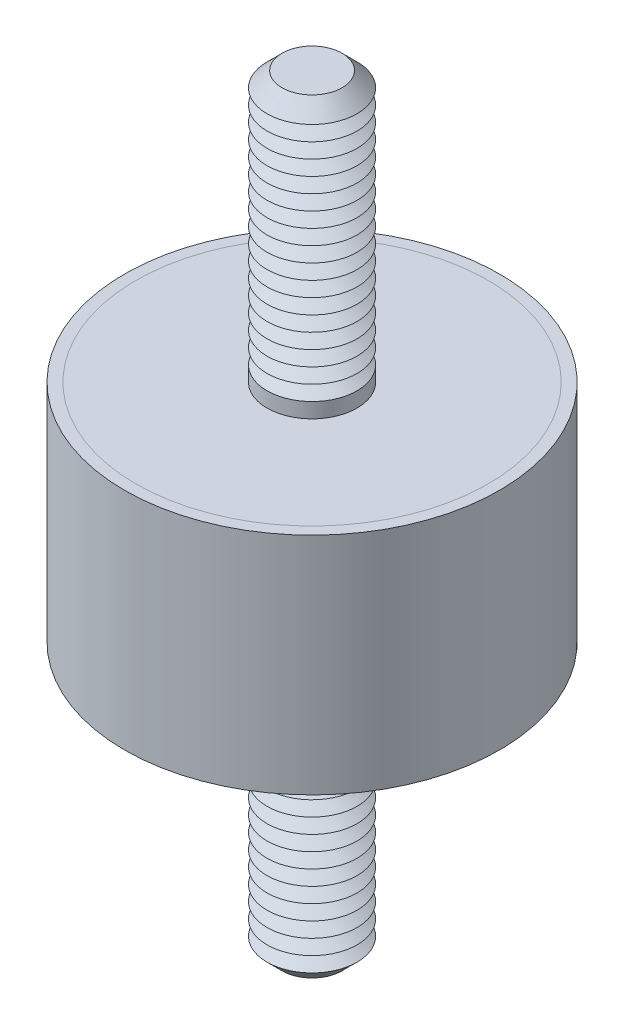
ISO-10303-21;
HEADER;
FILE_DESCRIPTION(('STEP AP214'),'2;1');
FILE_NAME('part.step','',(''),(''),'','','');
FILE_SCHEMA(('AUTOMOTIVE_DESIGN { 1 0 10303 214 1 1 1 1 }'));
ENDSEC;
DATA;
#1=APPLICATION_CONTEXT('core data for automotive mechanical design processes');
#2=APPLICATION_PROTOCOL_DEFINITION('international standard','automotive_design',2000,#1);
#3=PRODUCT_CONTEXT('',#1,'mechanical');
#4=PRODUCT('Part','Part','',(#3));
#5=PRODUCT_RELATED_PRODUCT_CATEGORY('part','',(#4));
#6=PRODUCT_DEFINITION_FORMATION('','',#4);
#7=PRODUCT_DEFINITION_CONTEXT('part definition',#1,'design');
#8=PRODUCT_DEFINITION('design','',#6,#7);
#9=PRODUCT_DEFINITION_SHAPE('','',#8);
#10=(LENGTH_UNIT() NAMED_UNIT(*) SI_UNIT(.MILLI.,.METRE.));
#11=(NAMED_UNIT(*) PLANE_ANGLE_UNIT() SI_UNIT($,.RADIAN.));
#12=(NAMED_UNIT(*) SI_UNIT($,.STERADIAN.) SOLID_ANGLE_UNIT());
#13=UNCERTAINTY_MEASURE_WITH_UNIT(LENGTH_MEASURE(1.E-05),#10,'distance_accuracy_value','');
#14=(GEOMETRIC_REPRESENTATION_CONTEXT(3) GLOBAL_UNCERTAINTY_ASSIGNED_CONTEXT((#13)) GLOBAL_UNIT_ASSIGNED_CONTEXT((#10,
#11,#12)) REPRESENTATION_CONTEXT('',''));
#15=CARTESIAN_POINT('',(0.,0.,0.));
#16=DIRECTION('',(0.,0.,1.));
#17=DIRECTION('',(1.,0.,0.));
#18=AXIS2_PLACEMENT_3D('',#15,#16,#17);
#19=CARTESIAN_POINT('',(0.,-25.5,0.));
#20=DIRECTION('',(0.,1.,0.));
#21=DIRECTION('',(0.,0.,1.));
#22=AXIS2_PLACEMENT_3D('',#19,#20,#21);
#23=CYLINDRICAL_SURFACE('',#22,3.);
#24=CARTESIAN_POINT('',(0.,-7.5,0.));
#25=DIRECTION('',(0.,-1.,0.));
#26=DIRECTION('',(0.,0.,-1.));
#27=AXIS2_PLACEMENT_3D('',#24,#25,#26);
#28=CIRCLE('',#27,3.);
#29=CARTESIAN_POINT('',(0.,-7.5,-3.));
#30=VERTEX_POINT('',#29);
#31=EDGE_CURVE('P0_E21',#30,#30,#28,.T.);
#32=ORIENTED_EDGE('',*,*,#31,.T.);
#33=EDGE_LOOP('',(#32));
#34=FACE_BOUND('',#33,.T.);
#35=CARTESIAN_POINT('',(0.,-8.5,0.));
#36=DIRECTION('',(0.,1.,0.));
#37=DIRECTION('',(0.,0.,1.));
#38=AXIS2_PLACEMENT_3D('',#35,#36,#37);
#39=CIRCLE('',#38,3.);
#40=CARTESIAN_POINT('',(0.,-8.5,3.));
#41=VERTEX_POINT('',#40);
#42=EDGE_CURVE('P0_E33',#41,#41,#39,.T.);
#43=ORIENTED_EDGE('',*,*,#42,.T.);
#44=EDGE_LOOP('',(#43));
#45=FACE_BOUND('',#44,.T.);
#46=ADVANCED_FACE('P0_F14',(#34,#45),#23,.T.);
#47=CARTESIAN_POINT('',(0.,-7.5,0.));
#48=DIRECTION('',(0.,1.,0.));
#49=DIRECTION('',(0.,0.,1.));
#50=AXIS2_PLACEMENT_3D('',#47,#48,#49);
#51=CYLINDRICAL_SURFACE('',#50,11.75);
#52=CARTESIAN_POINT('',(0.,-7.5,0.));
#53=DIRECTION('',(0.,1.,0.));
#54=DIRECTION('',(0.,0.,1.));
#55=AXIS2_PLACEMENT_3D('',#52,#53,#54);
#56=CIRCLE('',#55,11.75);
#57=CARTESIAN_POINT('',(0.,-7.5,11.75));
#58=VERTEX_POINT('',#57);
#59=EDGE_CURVE('P0_E25',#58,#58,#56,.T.);
#60=ORIENTED_EDGE('',*,*,#59,.T.);
#61=EDGE_LOOP('',(#60));
#62=FACE_BOUND('',#61,.T.);
#63=CARTESIAN_POINT('',(0.,-7.,0.));
#64=DIRECTION('',(0.,1.,0.));
#65=DIRECTION('',(0.,0.,1.));
#66=AXIS2_PLACEMENT_3D('',#63,#64,#65);
#67=CIRCLE('',#66,11.75);
#68=CARTESIAN_POINT('',(0.,-7.,11.75));
#69=VERTEX_POINT('',#68);
#70=EDGE_CURVE('P0_E30',#69,#69,#67,.T.);
#71=ORIENTED_EDGE('',*,*,#70,.F.);
#72=EDGE_LOOP('',(#71));
#73=FACE_BOUND('',#72,.T.);
#74=ADVANCED_FACE('P0_F157',(#62,#73),#51,.T.);
#75=CARTESIAN_POINT('',(0.,-7.5,0.));
#76=DIRECTION('',(0.,1.,0.));
#77=DIRECTION('',(0.,0.,1.));
#78=AXIS2_PLACEMENT_3D('',#75,#76,#77);
#79=PLANE('',#78);
#80=ORIENTED_EDGE('',*,*,#31,.F.);
#81=EDGE_LOOP('',(#80));
#82=FACE_BOUND('',#81,.T.);
#83=ORIENTED_EDGE('',*,*,#59,.F.);
#84=EDGE_LOOP('',(#83));
#85=FACE_BOUND('',#84,.T.);
#86=ADVANCED_FACE('P0_F162',(#82,#85),#79,.F.);
#87=CARTESIAN_POINT('',(0.,-7.,0.));
#88=DIRECTION('',(0.,1.,0.));
#89=DIRECTION('',(0.,0.,1.));
#90=AXIS2_PLACEMENT_3D('',#87,#88,#89);
#91=PLANE('',#90);
#92=ORIENTED_EDGE('',*,*,#70,.T.);
#93=EDGE_LOOP('',(#92));
#94=FACE_BOUND('',#93,.T.);
#95=ADVANCED_FACE('P0_F168',(#94),#91,.T.);
#96=CARTESIAN_POINT('',(0.,-8.5,0.));
#97=DIRECTION('',(0.,1.,0.));
#98=DIRECTION('',(0.,0.,1.));
#99=AXIS2_PLACEMENT_3D('',#96,#97,#98);
#100=CONICAL_SURFACE('',#99,3.,1.0471975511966);
#101=CARTESIAN_POINT('',(0.,-9.,0.));
#102=DIRECTION('',(0.,1.,0.));
#103=DIRECTION('',(0.,0.,1.));
#104=AXIS2_PLACEMENT_3D('',#101,#102,#103);
#105=CIRCLE('',#104,2.13397459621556);
#106=CARTESIAN_POINT('',(0.,-9.,2.13397459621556));
#107=VERTEX_POINT('',#106);
#108=EDGE_CURVE('P0_E39',#107,#107,#105,.T.);
#109=ORIENTED_EDGE('',*,*,#108,.T.);
#110=EDGE_LOOP('',(#109));
#111=FACE_BOUND('',#110,.T.);
#112=ORIENTED_EDGE('',*,*,#42,.F.);
#113=EDGE_LOOP('',(#112));
#114=FACE_BOUND('',#113,.T.);
#115=ADVANCED_FACE('P0_F171',(#111,#114),#100,.T.);
#116=CARTESIAN_POINT('',(0.,-9.,0.));
#117=DIRECTION('',(0.,-1.,0.));
#118=DIRECTION('',(0.,0.,-1.));
#119=AXIS2_PLACEMENT_3D('',#116,#117,#118);
#120=CONICAL_SURFACE('',#119,2.13397459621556,1.0471975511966);
#121=CARTESIAN_POINT('',(0.,-9.5,0.));
#122=DIRECTION('',(0.,1.,0.));
#123=DIRECTION('',(0.,0.,1.));
#124=AXIS2_PLACEMENT_3D('',#121,#122,#123);
#125=CIRCLE('',#124,3.);
#126=CARTESIAN_POINT('',(0.,-9.5,3.));
#127=VERTEX_POINT('',#126);
#128=EDGE_CURVE('P0_E43',#127,#127,#125,.T.);
#129=ORIENTED_EDGE('',*,*,#128,.T.);
#130=EDGE_LOOP('',(#129));
#131=FACE_BOUND('',#130,.T.);
#132=ORIENTED_EDGE('',*,*,#108,.F.);
#133=EDGE_LOOP('',(#132));
#134=FACE_BOUND('',#133,.T.);
#135=ADVANCED_FACE('P0_F175',(#131,#134),#120,.T.);
#136=CARTESIAN_POINT('',(0.,-9.5,0.));
#137=DIRECTION('',(0.,1.,0.));
#138=DIRECTION('',(0.,0.,1.));
#139=AXIS2_PLACEMENT_3D('',#136,#137,#138);
#140=CONICAL_SURFACE('',#139,3.,1.0471975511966);
#141=CARTESIAN_POINT('',(0.,-10.,0.));
#142=DIRECTION('',(0.,1.,0.));
#143=DIRECTION('',(0.,0.,1.));
#144=AXIS2_PLACEMENT_3D('',#141,#142,#143);
#145=CIRCLE('',#144,2.13397459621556);
#146=CARTESIAN_POINT('',(0.,-10.,2.13397459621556));
#147=VERTEX_POINT('',#146);
#148=EDGE_CURVE('P0_E47',#147,#147,#145,.T.);
#149=ORIENTED_EDGE('',*,*,#148,.T.);
#150=EDGE_LOOP('',(#149));
#151=FACE_BOUND('',#150,.T.);
#152=ORIENTED_EDGE('',*,*,#128,.F.);
#153=EDGE_LOOP('',(#152));
#154=FACE_BOUND('',#153,.T.);
#155=ADVANCED_FACE('P0_F179',(#151,#154),#140,.T.);
#156=CARTESIAN_POINT('',(0.,-10.,0.));
#157=DIRECTION('',(0.,-1.,0.));
#158=DIRECTION('',(0.,0.,-1.));
#159=AXIS2_PLACEMENT_3D('',#156,#157,#158);
#160=CONICAL_SURFACE('',#159,2.13397459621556,1.0471975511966);
#161=CARTESIAN_POINT('',(0.,-10.5,0.));
#162=DIRECTION('',(0.,1.,0.));
#163=DIRECTION('',(0.,0.,1.));
#164=AXIS2_PLACEMENT_3D('',#161,#162,#163);
#165=CIRCLE('',#164,3.);
#166=CARTESIAN_POINT('',(0.,-10.5,3.));
#167=VERTEX_POINT('',#166);
#168=EDGE_CURVE('P0_E52',#167,#167,#165,.T.);
#169=ORIENTED_EDGE('',*,*,#168,.T.);
#170=EDGE_LOOP('',(#169));
#171=FACE_BOUND('',#170,.T.);
#172=ORIENTED_EDGE('',*,*,#148,.F.);
#173=EDGE_LOOP('',(#172));
#174=FACE_BOUND('',#173,.T.);
#175=ADVANCED_FACE('P0_F186',(#171,#174),#160,.T.);
#176=CARTESIAN_POINT('',(0.,-10.5,0.));
#177=DIRECTION('',(0.,1.,0.));
#178=DIRECTION('',(0.,0.,1.));
#179=AXIS2_PLACEMENT_3D('',#176,#177,#178);
#180=CONICAL_SURFACE('',#179,3.,1.0471975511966);
#181=CARTESIAN_POINT('',(0.,-11.,0.));
#182=DIRECTION('',(0.,1.,0.));
#183=DIRECTION('',(0.,0.,1.));
#184=AXIS2_PLACEMENT_3D('',#181,#182,#183);
#185=CIRCLE('',#184,2.13397459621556);
#186=CARTESIAN_POINT('',(0.,-11.,2.13397459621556));
#187=VERTEX_POINT('',#186);
#188=EDGE_CURVE('P0_E55',#187,#187,#185,.T.);
#189=ORIENTED_EDGE('',*,*,#188,.T.);
#190=EDGE_LOOP('',(#189));
#191=FACE_BOUND('',#190,.T.);
#192=ORIENTED_EDGE('',*,*,#168,.F.);
#193=EDGE_LOOP('',(#192));
#194=FACE_BOUND('',#193,.T.);
#195=ADVANCED_FACE('P0_F190',(#191,#194),#180,.T.);
#196=CARTESIAN_POINT('',(0.,-11.,0.));
#197=DIRECTION('',(0.,-1.,0.));
#198=DIRECTION('',(0.,0.,-1.));
#199=AXIS2_PLACEMENT_3D('',#196,#197,#198);
#200=CONICAL_SURFACE('',#199,2.13397459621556,1.0471975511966);
#201=CARTESIAN_POINT('',(0.,-11.5,0.));
#202=DIRECTION('',(0.,1.,0.));
#203=DIRECTION('',(0.,0.,1.));
#204=AXIS2_PLACEMENT_3D('',#201,#202,#203);
#205=CIRCLE('',#204,3.);
#206=CARTESIAN_POINT('',(0.,-11.5,3.));
#207=VERTEX_POINT('',#206);
#208=EDGE_CURVE('P0_E58',#207,#207,#205,.T.);
#209=ORIENTED_EDGE('',*,*,#208,.T.);
#210=EDGE_LOOP('',(#209));
#211=FACE_BOUND('',#210,.T.);
#212=ORIENTED_EDGE('',*,*,#188,.F.);
#213=EDGE_LOOP('',(#212));
#214=FACE_BOUND('',#213,.T.);
#215=ADVANCED_FACE('P0_F194',(#211,#214),#200,.T.);
#216=CARTESIAN_POINT('',(0.,-11.5,0.));
#217=DIRECTION('',(0.,1.,0.));
#218=DIRECTION('',(0.,0.,1.));
#219=AXIS2_PLACEMENT_3D('',#216,#217,#218);
#220=CONICAL_SURFACE('',#219,3.,1.0471975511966);
#221=CARTESIAN_POINT('',(0.,-12.,0.));
#222=DIRECTION('',(0.,1.,0.));
#223=DIRECTION('',(0.,0.,1.));
#224=AXIS2_PLACEMENT_3D('',#221,#222,#223);
#225=CIRCLE('',#224,2.13397459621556);
#226=CARTESIAN_POINT('',(0.,-12.,2.13397459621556));
#227=VERTEX_POINT('',#226);
#228=EDGE_CURVE('P0_E61',#227,#227,#225,.T.);
#229=ORIENTED_EDGE('',*,*,#228,.T.);
#230=EDGE_LOOP('',(#229));
#231=FACE_BOUND('',#230,.T.);
#232=ORIENTED_EDGE('',*,*,#208,.F.);
#233=EDGE_LOOP('',(#232));
#234=FACE_BOUND('',#233,.T.);
#235=ADVANCED_FACE('P0_F198',(#231,#234),#220,.T.);
#236=CARTESIAN_POINT('',(0.,-12.,0.));
#237=DIRECTION('',(0.,-1.,0.));
#238=DIRECTION('',(0.,0.,-1.));
#239=AXIS2_PLACEMENT_3D('',#236,#237,#238);
#240=CONICAL_SURFACE('',#239,2.13397459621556,1.0471975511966);
#241=CARTESIAN_POINT('',(0.,-12.5,0.));
#242=DIRECTION('',(0.,1.,0.));
#243=DIRECTION('',(0.,0.,1.));
#244=AXIS2_PLACEMENT_3D('',#241,#242,#243);
#245=CIRCLE('',#244,3.);
#246=CARTESIAN_POINT('',(0.,-12.5,3.));
#247=VERTEX_POINT('',#246);
#248=EDGE_CURVE('P0_E64',#247,#247,#245,.T.);
#249=ORIENTED_EDGE('',*,*,#248,.T.);
#250=EDGE_LOOP('',(#249));
#251=FACE_BOUND('',#250,.T.);
#252=ORIENTED_EDGE('',*,*,#228,.F.);
#253=EDGE_LOOP('',(#252));
#254=FACE_BOUND('',#253,.T.);
#255=ADVANCED_FACE('P0_F202',(#251,#254),#240,.T.);
#256=CARTESIAN_POINT('',(0.,-12.5,0.));
#257=DIRECTION('',(0.,1.,0.));
#258=DIRECTION('',(0.,0.,1.));
#259=AXIS2_PLACEMENT_3D('',#256,#257,#258);
#260=CONICAL_SURFACE('',#259,3.,1.0471975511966);
#261=CARTESIAN_POINT('',(0.,-13.,0.));
#262=DIRECTION('',(0.,1.,0.));
#263=DIRECTION('',(0.,0.,1.));
#264=AXIS2_PLACEMENT_3D('',#261,#262,#263);
#265=CIRCLE('',#264,2.13397459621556);
#266=CARTESIAN_POINT('',(0.,-13.,2.13397459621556));
#267=VERTEX_POINT('',#266);
#268=EDGE_CURVE('P0_E67',#267,#267,#265,.T.);
#269=ORIENTED_EDGE('',*,*,#268,.T.);
#270=EDGE_LOOP('',(#269));
#271=FACE_BOUND('',#270,.T.);
#272=ORIENTED_EDGE('',*,*,#248,.F.);
#273=EDGE_LOOP('',(#272));
#274=FACE_BOUND('',#273,.T.);
#275=ADVANCED_FACE('P0_F206',(#271,#274),#260,.T.);
#276=CARTESIAN_POINT('',(0.,-13.,0.));
#277=DIRECTION('',(0.,-1.,0.));
#278=DIRECTION('',(0.,0.,-1.));
#279=AXIS2_PLACEMENT_3D('',#276,#277,#278);
#280=CONICAL_SURFACE('',#279,2.13397459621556,1.0471975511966);
#281=CARTESIAN_POINT('',(0.,-13.5,0.));
#282=DIRECTION('',(0.,1.,0.));
#283=DIRECTION('',(0.,0.,1.));
#284=AXIS2_PLACEMENT_3D('',#281,#282,#283);
#285=CIRCLE('',#284,3.);
#286=CARTESIAN_POINT('',(0.,-13.5,3.));
#287=VERTEX_POINT('',#286);
#288=EDGE_CURVE('P0_E70',#287,#287,#285,.T.);
#289=ORIENTED_EDGE('',*,*,#288,.T.);
#290=EDGE_LOOP('',(#289));
#291=FACE_BOUND('',#290,.T.);
#292=ORIENTED_EDGE('',*,*,#268,.F.);
#293=EDGE_LOOP('',(#292));
#294=FACE_BOUND('',#293,.T.);
#295=ADVANCED_FACE('P0_F210',(#291,#294),#280,.T.);
#296=CARTESIAN_POINT('',(0.,-13.5,0.));
#297=DIRECTION('',(0.,1.,0.));
#298=DIRECTION('',(0.,0.,1.));
#299=AXIS2_PLACEMENT_3D('',#296,#297,#298);
#300=CONICAL_SURFACE('',#299,3.,1.0471975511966);
#301=CARTESIAN_POINT('',(0.,-14.,0.));
#302=DIRECTION('',(0.,1.,0.));
#303=DIRECTION('',(0.,0.,1.));
#304=AXIS2_PLACEMENT_3D('',#301,#302,#303);
#305=CIRCLE('',#304,2.13397459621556);
#306=CARTESIAN_POINT('',(0.,-14.,2.13397459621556));
#307=VERTEX_POINT('',#306);
#308=EDGE_CURVE('P0_E73',#307,#307,#305,.T.);
#309=ORIENTED_EDGE('',*,*,#308,.T.);
#310=EDGE_LOOP('',(#309));
#311=FACE_BOUND('',#310,.T.);
#312=ORIENTED_EDGE('',*,*,#288,.F.);
#313=EDGE_LOOP('',(#312));
#314=FACE_BOUND('',#313,.T.);
#315=ADVANCED_FACE('P0_F214',(#311,#314),#300,.T.);
#316=CARTESIAN_POINT('',(0.,-14.,0.));
#317=DIRECTION('',(0.,-1.,0.));
#318=DIRECTION('',(0.,0.,-1.));
#319=AXIS2_PLACEMENT_3D('',#316,#317,#318);
#320=CONICAL_SURFACE('',#319,2.13397459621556,1.0471975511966);
#321=CARTESIAN_POINT('',(0.,-14.5,0.));
#322=DIRECTION('',(0.,1.,0.));
#323=DIRECTION('',(0.,0.,1.));
#324=AXIS2_PLACEMENT_3D('',#321,#322,#323);
#325=CIRCLE('',#324,3.);
#326=CARTESIAN_POINT('',(0.,-14.5,3.));
#327=VERTEX_POINT('',#326);
#328=EDGE_CURVE('P0_E76',#327,#327,#325,.T.);
#329=ORIENTED_EDGE('',*,*,#328,.T.);
#330=EDGE_LOOP('',(#329));
#331=FACE_BOUND('',#330,.T.);
#332=ORIENTED_EDGE('',*,*,#308,.F.);
#333=EDGE_LOOP('',(#332));
#334=FACE_BOUND('',#333,.T.);
#335=ADVANCED_FACE('P0_F218',(#331,#334),#320,.T.);
#336=CARTESIAN_POINT('',(0.,-14.5,0.));
#337=DIRECTION('',(0.,1.,0.));
#338=DIRECTION('',(0.,0.,1.));
#339=AXIS2_PLACEMENT_3D('',#336,#337,#338);
#340=CONICAL_SURFACE('',#339,3.,1.0471975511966);
#341=CARTESIAN_POINT('',(0.,-15.,0.));
#342=DIRECTION('',(0.,1.,0.));
#343=DIRECTION('',(0.,0.,1.));
#344=AXIS2_PLACEMENT_3D('',#341,#342,#343);
#345=CIRCLE('',#344,2.13397459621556);
#346=CARTESIAN_POINT('',(0.,-15.,2.13397459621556));
#347=VERTEX_POINT('',#346);
#348=EDGE_CURVE('P0_E79',#347,#347,#345,.T.);
#349=ORIENTED_EDGE('',*,*,#348,.T.);
#350=EDGE_LOOP('',(#349));
#351=FACE_BOUND('',#350,.T.);
#352=ORIENTED_EDGE('',*,*,#328,.F.);
#353=EDGE_LOOP('',(#352));
#354=FACE_BOUND('',#353,.T.);
#355=ADVANCED_FACE('P0_F222',(#351,#354),#340,.T.);
#356=CARTESIAN_POINT('',(0.,-15.,0.));
#357=DIRECTION('',(0.,-1.,0.));
#358=DIRECTION('',(0.,0.,-1.));
#359=AXIS2_PLACEMENT_3D('',#356,#357,#358);
#360=CONICAL_SURFACE('',#359,2.13397459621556,1.0471975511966);
#361=CARTESIAN_POINT('',(0.,-15.5,0.));
#362=DIRECTION('',(0.,1.,0.));
#363=DIRECTION('',(0.,0.,1.));
#364=AXIS2_PLACEMENT_3D('',#361,#362,#363);
#365=CIRCLE('',#364,3.);
#366=CARTESIAN_POINT('',(0.,-15.5,3.));
#367=VERTEX_POINT('',#366);
#368=EDGE_CURVE('P0_E82',#367,#367,#365,.T.);
#369=ORIENTED_EDGE('',*,*,#368,.T.);
#370=EDGE_LOOP('',(#369));
#371=FACE_BOUND('',#370,.T.);
#372=ORIENTED_EDGE('',*,*,#348,.F.);
#373=EDGE_LOOP('',(#372));
#374=FACE_BOUND('',#373,.T.);
#375=ADVANCED_FACE('P0_F226',(#371,#374),#360,.T.);
#376=CARTESIAN_POINT('',(0.,-15.5,0.));
#377=DIRECTION('',(0.,1.,0.));
#378=DIRECTION('',(0.,0.,1.));
#379=AXIS2_PLACEMENT_3D('',#376,#377,#378);
#380=CONICAL_SURFACE('',#379,3.,1.0471975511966);
#381=CARTESIAN_POINT('',(0.,-16.,0.));
#382=DIRECTION('',(0.,1.,0.));
#383=DIRECTION('',(0.,0.,1.));
#384=AXIS2_PLACEMENT_3D('',#381,#382,#383);
#385=CIRCLE('',#384,2.13397459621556);
#386=CARTESIAN_POINT('',(0.,-16.,2.13397459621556));
#387=VERTEX_POINT('',#386);
#388=EDGE_CURVE('P0_E85',#387,#387,#385,.T.);
#389=ORIENTED_EDGE('',*,*,#388,.T.);
#390=EDGE_LOOP('',(#389));
#391=FACE_BOUND('',#390,.T.);
#392=ORIENTED_EDGE('',*,*,#368,.F.);
#393=EDGE_LOOP('',(#392));
#394=FACE_BOUND('',#393,.T.);
#395=ADVANCED_FACE('P0_F230',(#391,#394),#380,.T.);
#396=CARTESIAN_POINT('',(0.,-16.,0.));
#397=DIRECTION('',(0.,-1.,0.));
#398=DIRECTION('',(0.,0.,-1.));
#399=AXIS2_PLACEMENT_3D('',#396,#397,#398);
#400=CONICAL_SURFACE('',#399,2.13397459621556,1.0471975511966);
#401=CARTESIAN_POINT('',(0.,-16.5,0.));
#402=DIRECTION('',(0.,1.,0.));
#403=DIRECTION('',(0.,0.,1.));
#404=AXIS2_PLACEMENT_3D('',#401,#402,#403);
#405=CIRCLE('',#404,3.);
#406=CARTESIAN_POINT('',(0.,-16.5,3.));
#407=VERTEX_POINT('',#406);
#408=EDGE_CURVE('P0_E88',#407,#407,#405,.T.);
#409=ORIENTED_EDGE('',*,*,#408,.T.);
#410=EDGE_LOOP('',(#409));
#411=FACE_BOUND('',#410,.T.);
#412=ORIENTED_EDGE('',*,*,#388,.F.);
#413=EDGE_LOOP('',(#412));
#414=FACE_BOUND('',#413,.T.);
#415=ADVANCED_FACE('P0_F234',(#411,#414),#400,.T.);
#416=CARTESIAN_POINT('',(0.,-16.5,0.));
#417=DIRECTION('',(0.,1.,0.));
#418=DIRECTION('',(0.,0.,1.));
#419=AXIS2_PLACEMENT_3D('',#416,#417,#418);
#420=CONICAL_SURFACE('',#419,3.,1.0471975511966);
#421=CARTESIAN_POINT('',(0.,-17.,0.));
#422=DIRECTION('',(0.,1.,0.));
#423=DIRECTION('',(0.,0.,1.));
#424=AXIS2_PLACEMENT_3D('',#421,#422,#423);
#425=CIRCLE('',#424,2.13397459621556);
#426=CARTESIAN_POINT('',(0.,-17.,2.13397459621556));
#427=VERTEX_POINT('',#426);
#428=EDGE_CURVE('P0_E91',#427,#427,#425,.T.);
#429=ORIENTED_EDGE('',*,*,#428,.T.);
#430=EDGE_LOOP('',(#429));
#431=FACE_BOUND('',#430,.T.);
#432=ORIENTED_EDGE('',*,*,#408,.F.);
#433=EDGE_LOOP('',(#432));
#434=FACE_BOUND('',#433,.T.);
#435=ADVANCED_FACE('P0_F238',(#431,#434),#420,.T.);
#436=CARTESIAN_POINT('',(0.,-17.,0.));
#437=DIRECTION('',(0.,-1.,0.));
#438=DIRECTION('',(0.,0.,-1.));
#439=AXIS2_PLACEMENT_3D('',#436,#437,#438);
#440=CONICAL_SURFACE('',#439,2.13397459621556,1.0471975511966);
#441=CARTESIAN_POINT('',(0.,-17.5,0.));
#442=DIRECTION('',(0.,1.,0.));
#443=DIRECTION('',(0.,0.,1.));
#444=AXIS2_PLACEMENT_3D('',#441,#442,#443);
#445=CIRCLE('',#444,3.);
#446=CARTESIAN_POINT('',(0.,-17.5,3.));
#447=VERTEX_POINT('',#446);
#448=EDGE_CURVE('P0_E94',#447,#447,#445,.T.);
#449=ORIENTED_EDGE('',*,*,#448,.T.);
#450=EDGE_LOOP('',(#449));
#451=FACE_BOUND('',#450,.T.);
#452=ORIENTED_EDGE('',*,*,#428,.F.);
#453=EDGE_LOOP('',(#452));
#454=FACE_BOUND('',#453,.T.);
#455=ADVANCED_FACE('P0_F242',(#451,#454),#440,.T.);
#456=CARTESIAN_POINT('',(0.,-17.5,0.));
#457=DIRECTION('',(0.,1.,0.));
#458=DIRECTION('',(0.,0.,1.));
#459=AXIS2_PLACEMENT_3D('',#456,#457,#458);
#460=CONICAL_SURFACE('',#459,3.,1.0471975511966);
#461=CARTESIAN_POINT('',(0.,-18.,0.));
#462=DIRECTION('',(0.,1.,0.));
#463=DIRECTION('',(0.,0.,1.));
#464=AXIS2_PLACEMENT_3D('',#461,#462,#463);
#465=CIRCLE('',#464,2.13397459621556);
#466=CARTESIAN_POINT('',(0.,-18.,2.13397459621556));
#467=VERTEX_POINT('',#466);
#468=EDGE_CURVE('P0_E97',#467,#467,#465,.T.);
#469=ORIENTED_EDGE('',*,*,#468,.T.);
#470=EDGE_LOOP('',(#469));
#471=FACE_BOUND('',#470,.T.);
#472=ORIENTED_EDGE('',*,*,#448,.F.);
#473=EDGE_LOOP('',(#472));
#474=FACE_BOUND('',#473,.T.);
#475=ADVANCED_FACE('P0_F246',(#471,#474),#460,.T.);
#476=CARTESIAN_POINT('',(0.,-18.,0.));
#477=DIRECTION('',(0.,-1.,0.));
#478=DIRECTION('',(0.,0.,-1.));
#479=AXIS2_PLACEMENT_3D('',#476,#477,#478);
#480=CONICAL_SURFACE('',#479,2.13397459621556,1.0471975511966);
#481=CARTESIAN_POINT('',(0.,-18.5,0.));
#482=DIRECTION('',(0.,1.,0.));
#483=DIRECTION('',(0.,0.,1.));
#484=AXIS2_PLACEMENT_3D('',#481,#482,#483);
#485=CIRCLE('',#484,3.);
#486=CARTESIAN_POINT('',(0.,-18.5,3.));
#487=VERTEX_POINT('',#486);
#488=EDGE_CURVE('P0_E100',#487,#487,#485,.T.);
#489=ORIENTED_EDGE('',*,*,#488,.T.);
#490=EDGE_LOOP('',(#489));
#491=FACE_BOUND('',#490,.T.);
#492=ORIENTED_EDGE('',*,*,#468,.F.);
#493=EDGE_LOOP('',(#492));
#494=FACE_BOUND('',#493,.T.);
#495=ADVANCED_FACE('P0_F250',(#491,#494),#480,.T.);
#496=CARTESIAN_POINT('',(0.,-18.5,0.));
#497=DIRECTION('',(0.,1.,0.));
#498=DIRECTION('',(0.,0.,1.));
#499=AXIS2_PLACEMENT_3D('',#496,#497,#498);
#500=CONICAL_SURFACE('',#499,3.,1.0471975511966);
#501=CARTESIAN_POINT('',(0.,-19.,0.));
#502=DIRECTION('',(0.,1.,0.));
#503=DIRECTION('',(0.,0.,1.));
#504=AXIS2_PLACEMENT_3D('',#501,#502,#503);
#505=CIRCLE('',#504,2.13397459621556);
#506=CARTESIAN_POINT('',(0.,-19.,2.13397459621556));
#507=VERTEX_POINT('',#506);
#508=EDGE_CURVE('P0_E103',#507,#507,#505,.T.);
#509=ORIENTED_EDGE('',*,*,#508,.T.);
#510=EDGE_LOOP('',(#509));
#511=FACE_BOUND('',#510,.T.);
#512=ORIENTED_EDGE('',*,*,#488,.F.);
#513=EDGE_LOOP('',(#512));
#514=FACE_BOUND('',#513,.T.);
#515=ADVANCED_FACE('P0_F254',(#511,#514),#500,.T.);
#516=CARTESIAN_POINT('',(0.,-19.,0.));
#517=DIRECTION('',(0.,-1.,0.));
#518=DIRECTION('',(0.,0.,-1.));
#519=AXIS2_PLACEMENT_3D('',#516,#517,#518);
#520=CONICAL_SURFACE('',#519,2.13397459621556,1.0471975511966);
#521=CARTESIAN_POINT('',(0.,-19.5,0.));
#522=DIRECTION('',(0.,1.,0.));
#523=DIRECTION('',(0.,0.,1.));
#524=AXIS2_PLACEMENT_3D('',#521,#522,#523);
#525=CIRCLE('',#524,3.);
#526=CARTESIAN_POINT('',(0.,-19.5,3.));
#527=VERTEX_POINT('',#526);
#528=EDGE_CURVE('P0_E106',#527,#527,#525,.T.);
#529=ORIENTED_EDGE('',*,*,#528,.T.);
#530=EDGE_LOOP('',(#529));
#531=FACE_BOUND('',#530,.T.);
#532=ORIENTED_EDGE('',*,*,#508,.F.);
#533=EDGE_LOOP('',(#532));
#534=FACE_BOUND('',#533,.T.);
#535=ADVANCED_FACE('P0_F258',(#531,#534),#520,.T.);
#536=CARTESIAN_POINT('',(0.,-19.5,0.));
#537=DIRECTION('',(0.,1.,0.));
#538=DIRECTION('',(0.,0.,1.));
#539=AXIS2_PLACEMENT_3D('',#536,#537,#538);
#540=CONICAL_SURFACE('',#539,3.,1.0471975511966);
#541=CARTESIAN_POINT('',(0.,-20.,0.));
#542=DIRECTION('',(0.,1.,0.));
#543=DIRECTION('',(0.,0.,1.));
#544=AXIS2_PLACEMENT_3D('',#541,#542,#543);
#545=CIRCLE('',#544,2.13397459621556);
#546=CARTESIAN_POINT('',(0.,-20.,2.13397459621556));
#547=VERTEX_POINT('',#546);
#548=EDGE_CURVE('P0_E109',#547,#547,#545,.T.);
#549=ORIENTED_EDGE('',*,*,#548,.T.);
#550=EDGE_LOOP('',(#549));
#551=FACE_BOUND('',#550,.T.);
#552=ORIENTED_EDGE('',*,*,#528,.F.);
#553=EDGE_LOOP('',(#552));
#554=FACE_BOUND('',#553,.T.);
#555=ADVANCED_FACE('P0_F262',(#551,#554),#540,.T.);
#556=CARTESIAN_POINT('',(0.,-20.,0.));
#557=DIRECTION('',(0.,-1.,0.));
#558=DIRECTION('',(0.,0.,-1.));
#559=AXIS2_PLACEMENT_3D('',#556,#557,#558);
#560=CONICAL_SURFACE('',#559,2.13397459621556,1.0471975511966);
#561=CARTESIAN_POINT('',(0.,-20.5,0.));
#562=DIRECTION('',(0.,1.,0.));
#563=DIRECTION('',(0.,0.,1.));
#564=AXIS2_PLACEMENT_3D('',#561,#562,#563);
#565=CIRCLE('',#564,3.);
#566=CARTESIAN_POINT('',(0.,-20.5,3.));
#567=VERTEX_POINT('',#566);
#568=EDGE_CURVE('P0_E112',#567,#567,#565,.T.);
#569=ORIENTED_EDGE('',*,*,#568,.T.);
#570=EDGE_LOOP('',(#569));
#571=FACE_BOUND('',#570,.T.);
#572=ORIENTED_EDGE('',*,*,#548,.F.);
#573=EDGE_LOOP('',(#572));
#574=FACE_BOUND('',#573,.T.);
#575=ADVANCED_FACE('P0_F266',(#571,#574),#560,.T.);
#576=CARTESIAN_POINT('',(0.,-20.5,0.));
#577=DIRECTION('',(0.,1.,0.));
#578=DIRECTION('',(0.,0.,1.));
#579=AXIS2_PLACEMENT_3D('',#576,#577,#578);
#580=CONICAL_SURFACE('',#579,3.,1.0471975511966);
#581=CARTESIAN_POINT('',(0.,-21.,0.));
#582=DIRECTION('',(0.,1.,0.));
#583=DIRECTION('',(0.,0.,1.));
#584=AXIS2_PLACEMENT_3D('',#581,#582,#583);
#585=CIRCLE('',#584,2.13397459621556);
#586=CARTESIAN_POINT('',(0.,-21.,2.13397459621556));
#587=VERTEX_POINT('',#586);
#588=EDGE_CURVE('P0_E115',#587,#587,#585,.T.);
#589=ORIENTED_EDGE('',*,*,#588,.T.);
#590=EDGE_LOOP('',(#589));
#591=FACE_BOUND('',#590,.T.);
#592=ORIENTED_EDGE('',*,*,#568,.F.);
#593=EDGE_LOOP('',(#592));
#594=FACE_BOUND('',#593,.T.);
#595=ADVANCED_FACE('P0_F270',(#591,#594),#580,.T.);
#596=CARTESIAN_POINT('',(0.,-21.,0.));
#597=DIRECTION('',(0.,-1.,0.));
#598=DIRECTION('',(0.,0.,-1.));
#599=AXIS2_PLACEMENT_3D('',#596,#597,#598);
#600=CONICAL_SURFACE('',#599,2.13397459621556,1.0471975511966);
#601=CARTESIAN_POINT('',(0.,-21.5,0.));
#602=DIRECTION('',(0.,1.,0.));
#603=DIRECTION('',(0.,0.,1.));
#604=AXIS2_PLACEMENT_3D('',#601,#602,#603);
#605=CIRCLE('',#604,3.);
#606=CARTESIAN_POINT('',(0.,-21.5,3.));
#607=VERTEX_POINT('',#606);
#608=EDGE_CURVE('P0_E118',#607,#607,#605,.T.);
#609=ORIENTED_EDGE('',*,*,#608,.T.);
#610=EDGE_LOOP('',(#609));
#611=FACE_BOUND('',#610,.T.);
#612=ORIENTED_EDGE('',*,*,#588,.F.);
#613=EDGE_LOOP('',(#612));
#614=FACE_BOUND('',#613,.T.);
#615=ADVANCED_FACE('P0_F274',(#611,#614),#600,.T.);
#616=CARTESIAN_POINT('',(0.,-21.5,0.));
#617=DIRECTION('',(0.,1.,0.));
#618=DIRECTION('',(0.,0.,1.));
#619=AXIS2_PLACEMENT_3D('',#616,#617,#618);
#620=CONICAL_SURFACE('',#619,3.,1.0471975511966);
#621=CARTESIAN_POINT('',(0.,-22.,0.));
#622=DIRECTION('',(0.,1.,0.));
#623=DIRECTION('',(0.,0.,1.));
#624=AXIS2_PLACEMENT_3D('',#621,#622,#623);
#625=CIRCLE('',#624,2.13397459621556);
#626=CARTESIAN_POINT('',(0.,-22.,2.13397459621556));
#627=VERTEX_POINT('',#626);
#628=EDGE_CURVE('P0_E121',#627,#627,#625,.T.);
#629=ORIENTED_EDGE('',*,*,#628,.T.);
#630=EDGE_LOOP('',(#629));
#631=FACE_BOUND('',#630,.T.);
#632=ORIENTED_EDGE('',*,*,#608,.F.);
#633=EDGE_LOOP('',(#632));
#634=FACE_BOUND('',#633,.T.);
#635=ADVANCED_FACE('P0_F278',(#631,#634),#620,.T.);
#636=CARTESIAN_POINT('',(0.,-22.,0.));
#637=DIRECTION('',(0.,-1.,0.));
#638=DIRECTION('',(0.,0.,-1.));
#639=AXIS2_PLACEMENT_3D('',#636,#637,#638);
#640=CONICAL_SURFACE('',#639,2.13397459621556,1.0471975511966);
#641=CARTESIAN_POINT('',(0.,-22.5,0.));
#642=DIRECTION('',(0.,1.,0.));
#643=DIRECTION('',(0.,0.,1.));
#644=AXIS2_PLACEMENT_3D('',#641,#642,#643);
#645=CIRCLE('',#644,3.);
#646=CARTESIAN_POINT('',(0.,-22.5,3.));
#647=VERTEX_POINT('',#646);
#648=EDGE_CURVE('P0_E124',#647,#647,#645,.T.);
#649=ORIENTED_EDGE('',*,*,#648,.T.);
#650=EDGE_LOOP('',(#649));
#651=FACE_BOUND('',#650,.T.);
#652=ORIENTED_EDGE('',*,*,#628,.F.);
#653=EDGE_LOOP('',(#652));
#654=FACE_BOUND('',#653,.T.);
#655=ADVANCED_FACE('P0_F282',(#651,#654),#640,.T.);
#656=CARTESIAN_POINT('',(0.,-22.5,0.));
#657=DIRECTION('',(0.,1.,0.));
#658=DIRECTION('',(0.,0.,1.));
#659=AXIS2_PLACEMENT_3D('',#656,#657,#658);
#660=CONICAL_SURFACE('',#659,3.,1.0471975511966);
#661=CARTESIAN_POINT('',(0.,-23.,0.));
#662=DIRECTION('',(0.,1.,0.));
#663=DIRECTION('',(0.,0.,1.));
#664=AXIS2_PLACEMENT_3D('',#661,#662,#663);
#665=CIRCLE('',#664,2.13397459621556);
#666=CARTESIAN_POINT('',(0.,-23.,2.13397459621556));
#667=VERTEX_POINT('',#666);
#668=EDGE_CURVE('P0_E127',#667,#667,#665,.T.);
#669=ORIENTED_EDGE('',*,*,#668,.T.);
#670=EDGE_LOOP('',(#669));
#671=FACE_BOUND('',#670,.T.);
#672=ORIENTED_EDGE('',*,*,#648,.F.);
#673=EDGE_LOOP('',(#672));
#674=FACE_BOUND('',#673,.T.);
#675=ADVANCED_FACE('P0_F286',(#671,#674),#660,.T.);
#676=CARTESIAN_POINT('',(0.,-23.,0.));
#677=DIRECTION('',(0.,-1.,0.));
#678=DIRECTION('',(0.,0.,-1.));
#679=AXIS2_PLACEMENT_3D('',#676,#677,#678);
#680=CONICAL_SURFACE('',#679,2.13397459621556,1.0471975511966);
#681=CARTESIAN_POINT('',(0.,-23.5,0.));
#682=DIRECTION('',(0.,1.,0.));
#683=DIRECTION('',(0.,0.,1.));
#684=AXIS2_PLACEMENT_3D('',#681,#682,#683);
#685=CIRCLE('',#684,3.);
#686=CARTESIAN_POINT('',(0.,-23.5,3.));
#687=VERTEX_POINT('',#686);
#688=EDGE_CURVE('P0_E130',#687,#687,#685,.T.);
#689=ORIENTED_EDGE('',*,*,#688,.T.);
#690=EDGE_LOOP('',(#689));
#691=FACE_BOUND('',#690,.T.);
#692=ORIENTED_EDGE('',*,*,#668,.F.);
#693=EDGE_LOOP('',(#692));
#694=FACE_BOUND('',#693,.T.);
#695=ADVANCED_FACE('P0_F154',(#691,#694),#680,.T.);
#696=CARTESIAN_POINT('',(0.,-23.5,0.));
#697=DIRECTION('',(0.,1.,0.));
#698=DIRECTION('',(0.,0.,1.));
#699=AXIS2_PLACEMENT_3D('',#696,#697,#698);
#700=CONICAL_SURFACE('',#699,3.,1.0471975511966);
#701=CARTESIAN_POINT('',(0.,-24.,0.));
#702=DIRECTION('',(0.,1.,0.));
#703=DIRECTION('',(0.,0.,1.));
#704=AXIS2_PLACEMENT_3D('',#701,#702,#703);
#705=CIRCLE('',#704,2.13397459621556);
#706=CARTESIAN_POINT('',(0.,-24.,2.13397459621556));
#707=VERTEX_POINT('',#706);
#708=EDGE_CURVE('P0_E136',#707,#707,#705,.T.);
#709=ORIENTED_EDGE('',*,*,#708,.T.);
#710=EDGE_LOOP('',(#709));
#711=FACE_BOUND('',#710,.T.);
#712=ORIENTED_EDGE('',*,*,#688,.F.);
#713=EDGE_LOOP('',(#712));
#714=FACE_BOUND('',#713,.T.);
#715=ADVANCED_FACE('P0_F140',(#711,#714),#700,.T.);
#716=CARTESIAN_POINT('',(0.,-24.,0.));
#717=DIRECTION('',(0.,-1.,0.));
#718=DIRECTION('',(0.,0.,-1.));
#719=AXIS2_PLACEMENT_3D('',#716,#717,#718);
#720=CONICAL_SURFACE('',#719,2.13397459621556,1.0471975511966);
#721=CARTESIAN_POINT('',(0.,-24.5,0.));
#722=DIRECTION('',(0.,1.,0.));
#723=DIRECTION('',(0.,0.,1.));
#724=AXIS2_PLACEMENT_3D('',#721,#722,#723);
#725=CIRCLE('',#724,3.);
#726=CARTESIAN_POINT('',(0.,-24.5,3.));
#727=VERTEX_POINT('',#726);
#728=EDGE_CURVE('P0_E133',#727,#727,#725,.T.);
#729=ORIENTED_EDGE('',*,*,#728,.T.);
#730=EDGE_LOOP('',(#729));
#731=FACE_BOUND('',#730,.T.);
#732=ORIENTED_EDGE('',*,*,#708,.F.);
#733=EDGE_LOOP('',(#732));
#734=FACE_BOUND('',#733,.T.);
#735=ADVANCED_FACE('P0_F143',(#731,#734),#720,.T.);
#736=CARTESIAN_POINT('',(0.,-25.5,0.));
#737=DIRECTION('',(0.,-1.,0.));
#738=DIRECTION('',(0.,0.,-1.));
#739=AXIS2_PLACEMENT_3D('',#736,#737,#738);
#740=PLANE('',#739);
#741=CARTESIAN_POINT('',(0.,-25.5,0.));
#742=DIRECTION('',(0.,-1.,0.));
#743=DIRECTION('',(0.,0.,-1.));
#744=AXIS2_PLACEMENT_3D('',#741,#742,#743);
#745=CIRCLE('',#744,1.99999999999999);
#746=CARTESIAN_POINT('',(0.,-25.5,-1.99999999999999));
#747=VERTEX_POINT('',#746);
#748=EDGE_CURVE('P0_E10',#747,#747,#745,.T.);
#749=ORIENTED_EDGE('',*,*,#748,.T.);
#750=EDGE_LOOP('',(#749));
#751=FACE_BOUND('',#750,.T.);
#752=ADVANCED_FACE('P0_F145',(#751),#740,.T.);
#753=CARTESIAN_POINT('',(0.,-25.5,0.));
#754=DIRECTION('',(0.,1.,0.));
#755=DIRECTION('',(0.,0.,1.));
#756=AXIS2_PLACEMENT_3D('',#753,#754,#755);
#757=CONICAL_SURFACE('',#756,1.99999999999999,0.785398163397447);
#758=ORIENTED_EDGE('',*,*,#728,.F.);
#759=EDGE_LOOP('',(#758));
#760=FACE_BOUND('',#759,.T.);
#761=ORIENTED_EDGE('',*,*,#748,.F.);
#762=EDGE_LOOP('',(#761));
#763=FACE_BOUND('',#762,.T.);
#764=ADVANCED_FACE('P0_F16',(#760,#763),#757,.T.);
#765=CLOSED_SHELL('',(#46,#74,#86,#95,#115,#135,#155,#175,#195,#215,#235,#255,#275,#295,#315,
#335,#355,#375,#395,#415,#435,#455,#475,#495,#515,#535,#555,#575,#595,#615,#635,#655,#675,#695,
#715,#735,#752,#764));
#766=MANIFOLD_SOLID_BREP('P0_B1',#765);
#767=CARTESIAN_POINT('',(0.,25.5,0.));
#768=DIRECTION('',(0.,-1.,0.));
#769=DIRECTION('',(0.,0.,-1.));
#770=AXIS2_PLACEMENT_3D('',#767,#768,#769);
#771=CYLINDRICAL_SURFACE('',#770,3.);
#772=CARTESIAN_POINT('',(0.,8.5,0.));
#773=DIRECTION('',(0.,1.,0.));
#774=DIRECTION('',(0.,0.,1.));
#775=AXIS2_PLACEMENT_3D('',#772,#773,#774);
#776=CIRCLE('',#775,3.);
#777=CARTESIAN_POINT('',(0.,8.5,3.));
#778=VERTEX_POINT('',#777);
#779=EDGE_CURVE('P1_E33',#778,#778,#776,.T.);
#780=ORIENTED_EDGE('',*,*,#779,.F.);
#781=EDGE_LOOP('',(#780));
#782=FACE_BOUND('',#781,.T.);
#783=CARTESIAN_POINT('',(0.,7.5,0.));
#784=DIRECTION('',(0.,1.,0.));
#785=DIRECTION('',(0.,0.,1.));
#786=AXIS2_PLACEMENT_3D('',#783,#784,#785);
#787=CIRCLE('',#786,3.);
#788=CARTESIAN_POINT('',(0.,7.5,3.));
#789=VERTEX_POINT('',#788);
#790=EDGE_CURVE('P1_E21',#789,#789,#787,.T.);
#791=ORIENTED_EDGE('',*,*,#790,.T.);
#792=EDGE_LOOP('',(#791));
#793=FACE_BOUND('',#792,.T.);
#794=ADVANCED_FACE('P1_F14',(#782,#793),#771,.T.);
#795=CARTESIAN_POINT('',(0.,7.5,0.));
#796=DIRECTION('',(0.,-1.,0.));
#797=DIRECTION('',(0.,0.,-1.));
#798=AXIS2_PLACEMENT_3D('',#795,#796,#797);
#799=CYLINDRICAL_SURFACE('',#798,11.75);
#800=CARTESIAN_POINT('',(0.,7.5,0.));
#801=DIRECTION('',(0.,1.,0.));
#802=DIRECTION('',(0.,0.,1.));
#803=AXIS2_PLACEMENT_3D('',#800,#801,#802);
#804=CIRCLE('',#803,11.75);
#805=CARTESIAN_POINT('',(0.,7.5,11.75));
#806=VERTEX_POINT('',#805);
#807=EDGE_CURVE('P1_E25',#806,#806,#804,.T.);
#808=ORIENTED_EDGE('',*,*,#807,.F.);
#809=EDGE_LOOP('',(#808));
#810=FACE_BOUND('',#809,.T.);
#811=CARTESIAN_POINT('',(0.,7.,0.));
#812=DIRECTION('',(0.,1.,0.));
#813=DIRECTION('',(0.,0.,1.));
#814=AXIS2_PLACEMENT_3D('',#811,#812,#813);
#815=CIRCLE('',#814,11.75);
#816=CARTESIAN_POINT('',(0.,7.,11.75));
#817=VERTEX_POINT('',#816);
#818=EDGE_CURVE('P1_E30',#817,#817,#815,.T.);
#819=ORIENTED_EDGE('',*,*,#818,.T.);
#820=EDGE_LOOP('',(#819));
#821=FACE_BOUND('',#820,.T.);
#822=ADVANCED_FACE('P1_F328',(#810,#821),#799,.T.);
#823=CARTESIAN_POINT('',(0.,7.5,0.));
#824=DIRECTION('',(0.,1.,0.));
#825=DIRECTION('',(0.,0.,1.));
#826=AXIS2_PLACEMENT_3D('',#823,#824,#825);
#827=PLANE('',#826);
#828=ORIENTED_EDGE('',*,*,#790,.F.);
#829=EDGE_LOOP('',(#828));
#830=FACE_BOUND('',#829,.T.);
#831=ORIENTED_EDGE('',*,*,#807,.T.);
#832=EDGE_LOOP('',(#831));
#833=FACE_BOUND('',#832,.T.);
#834=ADVANCED_FACE('P1_F334',(#830,#833),#827,.T.);
#835=CARTESIAN_POINT('',(0.,7.,0.));
#836=DIRECTION('',(0.,1.,0.));
#837=DIRECTION('',(0.,0.,1.));
#838=AXIS2_PLACEMENT_3D('',#835,#836,#837);
#839=PLANE('',#838);
#840=ORIENTED_EDGE('',*,*,#818,.F.);
#841=EDGE_LOOP('',(#840));
#842=FACE_BOUND('',#841,.T.);
#843=ADVANCED_FACE('P1_F324',(#842),#839,.F.);
#844=CARTESIAN_POINT('',(0.,8.5,0.));
#845=DIRECTION('',(0.,-1.,0.));
#846=DIRECTION('',(0.,0.,-1.));
#847=AXIS2_PLACEMENT_3D('',#844,#845,#846);
#848=CONICAL_SURFACE('',#847,3.,1.0471975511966);
#849=CARTESIAN_POINT('',(0.,9.,0.));
#850=DIRECTION('',(0.,1.,0.));
#851=DIRECTION('',(0.,0.,1.));
#852=AXIS2_PLACEMENT_3D('',#849,#850,#851);
#853=CIRCLE('',#852,2.13397459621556);
#854=CARTESIAN_POINT('',(0.,9.,2.13397459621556));
#855=VERTEX_POINT('',#854);
#856=EDGE_CURVE('P1_E39',#855,#855,#853,.T.);
#857=ORIENTED_EDGE('',*,*,#856,.F.);
#858=EDGE_LOOP('',(#857));
#859=FACE_BOUND('',#858,.T.);
#860=ORIENTED_EDGE('',*,*,#779,.T.);
#861=EDGE_LOOP('',(#860));
#862=FACE_BOUND('',#861,.T.);
#863=ADVANCED_FACE('P1_F318',(#859,#862),#848,.T.);
#864=CARTESIAN_POINT('',(0.,9.,0.));
#865=DIRECTION('',(0.,1.,0.));
#866=DIRECTION('',(0.,0.,1.));
#867=AXIS2_PLACEMENT_3D('',#864,#865,#866);
#868=CONICAL_SURFACE('',#867,2.13397459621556,1.0471975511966);
#869=CARTESIAN_POINT('',(0.,9.5,0.));
#870=DIRECTION('',(0.,1.,0.));
#871=DIRECTION('',(0.,0.,1.));
#872=AXIS2_PLACEMENT_3D('',#869,#870,#871);
#873=CIRCLE('',#872,3.);
#874=CARTESIAN_POINT('',(0.,9.5,3.));
#875=VERTEX_POINT('',#874);
#876=EDGE_CURVE('P1_E43',#875,#875,#873,.T.);
#877=ORIENTED_EDGE('',*,*,#876,.F.);
#878=EDGE_LOOP('',(#877));
#879=FACE_BOUND('',#878,.T.);
#880=ORIENTED_EDGE('',*,*,#856,.T.);
#881=EDGE_LOOP('',(#880));
#882=FACE_BOUND('',#881,.T.);
#883=ADVANCED_FACE('P1_F313',(#879,#882),#868,.T.);
#884=CARTESIAN_POINT('',(0.,9.5,0.));
#885=DIRECTION('',(0.,-1.,0.));
#886=DIRECTION('',(0.,0.,-1.));
#887=AXIS2_PLACEMENT_3D('',#884,#885,#886);
#888=CONICAL_SURFACE('',#887,3.,1.0471975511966);
#889=CARTESIAN_POINT('',(0.,10.,0.));
#890=DIRECTION('',(0.,1.,0.));
#891=DIRECTION('',(0.,0.,1.));
#892=AXIS2_PLACEMENT_3D('',#889,#890,#891);
#893=CIRCLE('',#892,2.13397459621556);
#894=CARTESIAN_POINT('',(0.,10.,2.13397459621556));
#895=VERTEX_POINT('',#894);
#896=EDGE_CURVE('P1_E47',#895,#895,#893,.T.);
#897=ORIENTED_EDGE('',*,*,#896,.F.);
#898=EDGE_LOOP('',(#897));
#899=FACE_BOUND('',#898,.T.);
#900=ORIENTED_EDGE('',*,*,#876,.T.);
#901=EDGE_LOOP('',(#900));
#902=FACE_BOUND('',#901,.T.);
#903=ADVANCED_FACE('P1_F307',(#899,#902),#888,.T.);
#904=CARTESIAN_POINT('',(0.,10.,0.));
#905=DIRECTION('',(0.,1.,0.));
#906=DIRECTION('',(0.,0.,1.));
#907=AXIS2_PLACEMENT_3D('',#904,#905,#906);
#908=CONICAL_SURFACE('',#907,2.13397459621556,1.0471975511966);
#909=CARTESIAN_POINT('',(0.,10.5,0.));
#910=DIRECTION('',(0.,1.,0.));
#911=DIRECTION('',(0.,0.,1.));
#912=AXIS2_PLACEMENT_3D('',#909,#910,#911);
#913=CIRCLE('',#912,3.);
#914=CARTESIAN_POINT('',(0.,10.5,3.));
#915=VERTEX_POINT('',#914);
#916=EDGE_CURVE('P1_E52',#915,#915,#913,.T.);
#917=ORIENTED_EDGE('',*,*,#916,.F.);
#918=EDGE_LOOP('',(#917));
#919=FACE_BOUND('',#918,.T.);
#920=ORIENTED_EDGE('',*,*,#896,.T.);
#921=EDGE_LOOP('',(#920));
#922=FACE_BOUND('',#921,.T.);
#923=ADVANCED_FACE('P1_F301',(#919,#922),#908,.T.);
#924=CARTESIAN_POINT('',(0.,10.5,0.));
#925=DIRECTION('',(0.,-1.,0.));
#926=DIRECTION('',(0.,0.,-1.));
#927=AXIS2_PLACEMENT_3D('',#924,#925,#926);
#928=CONICAL_SURFACE('',#927,3.,1.0471975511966);
#929=CARTESIAN_POINT('',(0.,11.,0.));
#930=DIRECTION('',(0.,1.,0.));
#931=DIRECTION('',(0.,0.,1.));
#932=AXIS2_PLACEMENT_3D('',#929,#930,#931);
#933=CIRCLE('',#932,2.13397459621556);
#934=CARTESIAN_POINT('',(0.,11.,2.13397459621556));
#935=VERTEX_POINT('',#934);
#936=EDGE_CURVE('P1_E55',#935,#935,#933,.T.);
#937=ORIENTED_EDGE('',*,*,#936,.F.);
#938=EDGE_LOOP('',(#937));
#939=FACE_BOUND('',#938,.T.);
#940=ORIENTED_EDGE('',*,*,#916,.T.);
#941=EDGE_LOOP('',(#940));
#942=FACE_BOUND('',#941,.T.);
#943=ADVANCED_FACE('P1_F295',(#939,#942),#928,.T.);
#944=CARTESIAN_POINT('',(0.,11.,0.));
#945=DIRECTION('',(0.,1.,0.));
#946=DIRECTION('',(0.,0.,1.));
#947=AXIS2_PLACEMENT_3D('',#944,#945,#946);
#948=CONICAL_SURFACE('',#947,2.13397459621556,1.0471975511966);
#949=CARTESIAN_POINT('',(0.,11.5,0.));
#950=DIRECTION('',(0.,1.,0.));
#951=DIRECTION('',(0.,0.,1.));
#952=AXIS2_PLACEMENT_3D('',#949,#950,#951);
#953=CIRCLE('',#952,3.);
#954=CARTESIAN_POINT('',(0.,11.5,3.));
#955=VERTEX_POINT('',#954);
#956=EDGE_CURVE('P1_E58',#955,#955,#953,.T.);
#957=ORIENTED_EDGE('',*,*,#956,.F.);
#958=EDGE_LOOP('',(#957));
#959=FACE_BOUND('',#958,.T.);
#960=ORIENTED_EDGE('',*,*,#936,.T.);
#961=EDGE_LOOP('',(#960));
#962=FACE_BOUND('',#961,.T.);
#963=ADVANCED_FACE('P1_F289',(#959,#962),#948,.T.);
#964=CARTESIAN_POINT('',(0.,11.5,0.));
#965=DIRECTION('',(0.,-1.,0.));
#966=DIRECTION('',(0.,0.,-1.));
#967=AXIS2_PLACEMENT_3D('',#964,#965,#966);
#968=CONICAL_SURFACE('',#967,3.,1.0471975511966);
#969=CARTESIAN_POINT('',(0.,12.,0.));
#970=DIRECTION('',(0.,1.,0.));
#971=DIRECTION('',(0.,0.,1.));
#972=AXIS2_PLACEMENT_3D('',#969,#970,#971);
#973=CIRCLE('',#972,2.13397459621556);
#974=CARTESIAN_POINT('',(0.,12.,2.13397459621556));
#975=VERTEX_POINT('',#974);
#976=EDGE_CURVE('P1_E61',#975,#975,#973,.T.);
#977=ORIENTED_EDGE('',*,*,#976,.F.);
#978=EDGE_LOOP('',(#977));
#979=FACE_BOUND('',#978,.T.);
#980=ORIENTED_EDGE('',*,*,#956,.T.);
#981=EDGE_LOOP('',(#980));
#982=FACE_BOUND('',#981,.T.);
#983=ADVANCED_FACE('P1_F283',(#979,#982),#968,.T.);
#984=CARTESIAN_POINT('',(0.,12.,0.));
#985=DIRECTION('',(0.,1.,0.));
#986=DIRECTION('',(0.,0.,1.));
#987=AXIS2_PLACEMENT_3D('',#984,#985,#986);
#988=CONICAL_SURFACE('',#987,2.13397459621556,1.0471975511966);
#989=CARTESIAN_POINT('',(0.,12.5,0.));
#990=DIRECTION('',(0.,1.,0.));
#991=DIRECTION('',(0.,0.,1.));
#992=AXIS2_PLACEMENT_3D('',#989,#990,#991);
#993=CIRCLE('',#992,3.);
#994=CARTESIAN_POINT('',(0.,12.5,3.));
#995=VERTEX_POINT('',#994);
#996=EDGE_CURVE('P1_E64',#995,#995,#993,.T.);
#997=ORIENTED_EDGE('',*,*,#996,.F.);
#998=EDGE_LOOP('',(#997));
#999=FACE_BOUND('',#998,.T.);
#1000=ORIENTED_EDGE('',*,*,#976,.T.);
#1001=EDGE_LOOP('',(#1000));
#1002=FACE_BOUND('',#1001,.T.);
#1003=ADVANCED_FACE('P1_F277',(#999,#1002),#988,.T.);
#1004=CARTESIAN_POINT('',(0.,12.5,0.));
#1005=DIRECTION('',(0.,-1.,0.));
#1006=DIRECTION('',(0.,0.,-1.));
#1007=AXIS2_PLACEMENT_3D('',#1004,#1005,#1006);
#1008=CONICAL_SURFACE('',#1007,3.,1.0471975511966);
#1009=CARTESIAN_POINT('',(0.,13.,0.));
#1010=DIRECTION('',(0.,1.,0.));
#1011=DIRECTION('',(0.,0.,1.));
#1012=AXIS2_PLACEMENT_3D('',#1009,#1010,#1011);
#1013=CIRCLE('',#1012,2.13397459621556);
#1014=CARTESIAN_POINT('',(0.,13.,2.13397459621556));
#1015=VERTEX_POINT('',#1014);
#1016=EDGE_CURVE('P1_E67',#1015,#1015,#1013,.T.);
#1017=ORIENTED_EDGE('',*,*,#1016,.F.);
#1018=EDGE_LOOP('',(#1017));
#1019=FACE_BOUND('',#1018,.T.);
#1020=ORIENTED_EDGE('',*,*,#996,.T.);
#1021=EDGE_LOOP('',(#1020));
#1022=FACE_BOUND('',#1021,.T.);
#1023=ADVANCED_FACE('P1_F271',(#1019,#1022),#1008,.T.);
#1024=CARTESIAN_POINT('',(0.,13.,0.));
#1025=DIRECTION('',(0.,1.,0.));
#1026=DIRECTION('',(0.,0.,1.));
#1027=AXIS2_PLACEMENT_3D('',#1024,#1025,#1026);
#1028=CONICAL_SURFACE('',#1027,2.13397459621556,1.0471975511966);
#1029=CARTESIAN_POINT('',(0.,13.5,0.));
#1030=DIRECTION('',(0.,1.,0.));
#1031=DIRECTION('',(0.,0.,1.));
#1032=AXIS2_PLACEMENT_3D('',#1029,#1030,#1031);
#1033=CIRCLE('',#1032,3.);
#1034=CARTESIAN_POINT('',(0.,13.5,3.));
#1035=VERTEX_POINT('',#1034);
#1036=EDGE_CURVE('P1_E70',#1035,#1035,#1033,.T.);
#1037=ORIENTED_EDGE('',*,*,#1036,.F.);
#1038=EDGE_LOOP('',(#1037));
#1039=FACE_BOUND('',#1038,.T.);
#1040=ORIENTED_EDGE('',*,*,#1016,.T.);
#1041=EDGE_LOOP('',(#1040));
#1042=FACE_BOUND('',#1041,.T.);
#1043=ADVANCED_FACE('P1_F265',(#1039,#1042),#1028,.T.);
#1044=CARTESIAN_POINT('',(0.,13.5,0.));
#1045=DIRECTION('',(0.,-1.,0.));
#1046=DIRECTION('',(0.,0.,-1.));
#1047=AXIS2_PLACEMENT_3D('',#1044,#1045,#1046);
#1048=CONICAL_SURFACE('',#1047,3.,1.0471975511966);
#1049=CARTESIAN_POINT('',(0.,14.,0.));
#1050=DIRECTION('',(0.,1.,0.));
#1051=DIRECTION('',(0.,0.,1.));
#1052=AXIS2_PLACEMENT_3D('',#1049,#1050,#1051);
#1053=CIRCLE('',#1052,2.13397459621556);
#1054=CARTESIAN_POINT('',(0.,14.,2.13397459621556));
#1055=VERTEX_POINT('',#1054);
#1056=EDGE_CURVE('P1_E73',#1055,#1055,#1053,.T.);
#1057=ORIENTED_EDGE('',*,*,#1056,.F.);
#1058=EDGE_LOOP('',(#1057));
#1059=FACE_BOUND('',#1058,.T.);
#1060=ORIENTED_EDGE('',*,*,#1036,.T.);
#1061=EDGE_LOOP('',(#1060));
#1062=FACE_BOUND('',#1061,.T.);
#1063=ADVANCED_FACE('P1_F259',(#1059,#1062),#1048,.T.);
#1064=CARTESIAN_POINT('',(0.,14.,0.));
#1065=DIRECTION('',(0.,1.,0.));
#1066=DIRECTION('',(0.,0.,1.));
#1067=AXIS2_PLACEMENT_3D('',#1064,#1065,#1066);
#1068=CONICAL_SURFACE('',#1067,2.13397459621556,1.0471975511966);
#1069=CARTESIAN_POINT('',(0.,14.5,0.));
#1070=DIRECTION('',(0.,1.,0.));
#1071=DIRECTION('',(0.,0.,1.));
#1072=AXIS2_PLACEMENT_3D('',#1069,#1070,#1071);
#1073=CIRCLE('',#1072,3.);
#1074=CARTESIAN_POINT('',(0.,14.5,3.));
#1075=VERTEX_POINT('',#1074);
#1076=EDGE_CURVE('P1_E76',#1075,#1075,#1073,.T.);
#1077=ORIENTED_EDGE('',*,*,#1076,.F.);
#1078=EDGE_LOOP('',(#1077));
#1079=FACE_BOUND('',#1078,.T.);
#1080=ORIENTED_EDGE('',*,*,#1056,.T.);
#1081=EDGE_LOOP('',(#1080));
#1082=FACE_BOUND('',#1081,.T.);
#1083=ADVANCED_FACE('P1_F253',(#1079,#1082),#1068,.T.);
#1084=CARTESIAN_POINT('',(0.,14.5,0.));
#1085=DIRECTION('',(0.,-1.,0.));
#1086=DIRECTION('',(0.,0.,-1.));
#1087=AXIS2_PLACEMENT_3D('',#1084,#1085,#1086);
#1088=CONICAL_SURFACE('',#1087,3.,1.0471975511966);
#1089=CARTESIAN_POINT('',(0.,15.,0.));
#1090=DIRECTION('',(0.,1.,0.));
#1091=DIRECTION('',(0.,0.,1.));
#1092=AXIS2_PLACEMENT_3D('',#1089,#1090,#1091);
#1093=CIRCLE('',#1092,2.13397459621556);
#1094=CARTESIAN_POINT('',(0.,15.,2.13397459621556));
#1095=VERTEX_POINT('',#1094);
#1096=EDGE_CURVE('P1_E79',#1095,#1095,#1093,.T.);
#1097=ORIENTED_EDGE('',*,*,#1096,.F.);
#1098=EDGE_LOOP('',(#1097));
#1099=FACE_BOUND('',#1098,.T.);
#1100=ORIENTED_EDGE('',*,*,#1076,.T.);
#1101=EDGE_LOOP('',(#1100));
#1102=FACE_BOUND('',#1101,.T.);
#1103=ADVANCED_FACE('P1_F247',(#1099,#1102),#1088,.T.);
#1104=CARTESIAN_POINT('',(0.,15.,0.));
#1105=DIRECTION('',(0.,1.,0.));
#1106=DIRECTION('',(0.,0.,1.));
#1107=AXIS2_PLACEMENT_3D('',#1104,#1105,#1106);
#1108=CONICAL_SURFACE('',#1107,2.13397459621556,1.0471975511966);
#1109=CARTESIAN_POINT('',(0.,15.5,0.));
#1110=DIRECTION('',(0.,1.,0.));
#1111=DIRECTION('',(0.,0.,1.));
#1112=AXIS2_PLACEMENT_3D('',#1109,#1110,#1111);
#1113=CIRCLE('',#1112,3.);
#1114=CARTESIAN_POINT('',(0.,15.5,3.));
#1115=VERTEX_POINT('',#1114);
#1116=EDGE_CURVE('P1_E82',#1115,#1115,#1113,.T.);
#1117=ORIENTED_EDGE('',*,*,#1116,.F.);
#1118=EDGE_LOOP('',(#1117));
#1119=FACE_BOUND('',#1118,.T.);
#1120=ORIENTED_EDGE('',*,*,#1096,.T.);
#1121=EDGE_LOOP('',(#1120));
#1122=FACE_BOUND('',#1121,.T.);
#1123=ADVANCED_FACE('P1_F241',(#1119,#1122),#1108,.T.);
#1124=CARTESIAN_POINT('',(0.,15.5,0.));
#1125=DIRECTION('',(0.,-1.,0.));
#1126=DIRECTION('',(0.,0.,-1.));
#1127=AXIS2_PLACEMENT_3D('',#1124,#1125,#1126);
#1128=CONICAL_SURFACE('',#1127,3.,1.0471975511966);
#1129=CARTESIAN_POINT('',(0.,16.,0.));
#1130=DIRECTION('',(0.,1.,0.));
#1131=DIRECTION('',(0.,0.,1.));
#1132=AXIS2_PLACEMENT_3D('',#1129,#1130,#1131);
#1133=CIRCLE('',#1132,2.13397459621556);
#1134=CARTESIAN_POINT('',(0.,16.,2.13397459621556));
#1135=VERTEX_POINT('',#1134);
#1136=EDGE_CURVE('P1_E85',#1135,#1135,#1133,.T.);
#1137=ORIENTED_EDGE('',*,*,#1136,.F.);
#1138=EDGE_LOOP('',(#1137));
#1139=FACE_BOUND('',#1138,.T.);
#1140=ORIENTED_EDGE('',*,*,#1116,.T.);
#1141=EDGE_LOOP('',(#1140));
#1142=FACE_BOUND('',#1141,.T.);
#1143=ADVANCED_FACE('P1_F235',(#1139,#1142),#1128,.T.);
#1144=CARTESIAN_POINT('',(0.,16.,0.));
#1145=DIRECTION('',(0.,1.,0.));
#1146=DIRECTION('',(0.,0.,1.));
#1147=AXIS2_PLACEMENT_3D('',#1144,#1145,#1146);
#1148=CONICAL_SURFACE('',#1147,2.13397459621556,1.0471975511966);
#1149=CARTESIAN_POINT('',(0.,16.5,0.));
#1150=DIRECTION('',(0.,1.,0.));
#1151=DIRECTION('',(0.,0.,1.));
#1152=AXIS2_PLACEMENT_3D('',#1149,#1150,#1151);
#1153=CIRCLE('',#1152,3.);
#1154=CARTESIAN_POINT('',(0.,16.5,3.));
#1155=VERTEX_POINT('',#1154);
#1156=EDGE_CURVE('P1_E88',#1155,#1155,#1153,.T.);
#1157=ORIENTED_EDGE('',*,*,#1156,.F.);
#1158=EDGE_LOOP('',(#1157));
#1159=FACE_BOUND('',#1158,.T.);
#1160=ORIENTED_EDGE('',*,*,#1136,.T.);
#1161=EDGE_LOOP('',(#1160));
#1162=FACE_BOUND('',#1161,.T.);
#1163=ADVANCED_FACE('P1_F229',(#1159,#1162),#1148,.T.);
#1164=CARTESIAN_POINT('',(0.,16.5,0.));
#1165=DIRECTION('',(0.,-1.,0.));
#1166=DIRECTION('',(0.,0.,-1.));
#1167=AXIS2_PLACEMENT_3D('',#1164,#1165,#1166);
#1168=CONICAL_SURFACE('',#1167,3.,1.0471975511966);
#1169=CARTESIAN_POINT('',(0.,17.,0.));
#1170=DIRECTION('',(0.,1.,0.));
#1171=DIRECTION('',(0.,0.,1.));
#1172=AXIS2_PLACEMENT_3D('',#1169,#1170,#1171);
#1173=CIRCLE('',#1172,2.13397459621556);
#1174=CARTESIAN_POINT('',(0.,17.,2.13397459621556));
#1175=VERTEX_POINT('',#1174);
#1176=EDGE_CURVE('P1_E91',#1175,#1175,#1173,.T.);
#1177=ORIENTED_EDGE('',*,*,#1176,.F.);
#1178=EDGE_LOOP('',(#1177));
#1179=FACE_BOUND('',#1178,.T.);
#1180=ORIENTED_EDGE('',*,*,#1156,.T.);
#1181=EDGE_LOOP('',(#1180));
#1182=FACE_BOUND('',#1181,.T.);
#1183=ADVANCED_FACE('P1_F223',(#1179,#1182),#1168,.T.);
#1184=CARTESIAN_POINT('',(0.,17.,0.));
#1185=DIRECTION('',(0.,1.,0.));
#1186=DIRECTION('',(0.,0.,1.));
#1187=AXIS2_PLACEMENT_3D('',#1184,#1185,#1186);
#1188=CONICAL_SURFACE('',#1187,2.13397459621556,1.0471975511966);
#1189=CARTESIAN_POINT('',(0.,17.5,0.));
#1190=DIRECTION('',(0.,1.,0.));
#1191=DIRECTION('',(0.,0.,1.));
#1192=AXIS2_PLACEMENT_3D('',#1189,#1190,#1191);
#1193=CIRCLE('',#1192,3.);
#1194=CARTESIAN_POINT('',(0.,17.5,3.));
#1195=VERTEX_POINT('',#1194);
#1196=EDGE_CURVE('P1_E94',#1195,#1195,#1193,.T.);
#1197=ORIENTED_EDGE('',*,*,#1196,.F.);
#1198=EDGE_LOOP('',(#1197));
#1199=FACE_BOUND('',#1198,.T.);
#1200=ORIENTED_EDGE('',*,*,#1176,.T.);
#1201=EDGE_LOOP('',(#1200));
#1202=FACE_BOUND('',#1201,.T.);
#1203=ADVANCED_FACE('P1_F217',(#1199,#1202),#1188,.T.);
#1204=CARTESIAN_POINT('',(0.,17.5,0.));
#1205=DIRECTION('',(0.,-1.,0.));
#1206=DIRECTION('',(0.,0.,-1.));
#1207=AXIS2_PLACEMENT_3D('',#1204,#1205,#1206);
#1208=CONICAL_SURFACE('',#1207,3.,1.0471975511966);
#1209=CARTESIAN_POINT('',(0.,18.,0.));
#1210=DIRECTION('',(0.,1.,0.));
#1211=DIRECTION('',(0.,0.,1.));
#1212=AXIS2_PLACEMENT_3D('',#1209,#1210,#1211);
#1213=CIRCLE('',#1212,2.13397459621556);
#1214=CARTESIAN_POINT('',(0.,18.,2.13397459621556));
#1215=VERTEX_POINT('',#1214);
#1216=EDGE_CURVE('P1_E97',#1215,#1215,#1213,.T.);
#1217=ORIENTED_EDGE('',*,*,#1216,.F.);
#1218=EDGE_LOOP('',(#1217));
#1219=FACE_BOUND('',#1218,.T.);
#1220=ORIENTED_EDGE('',*,*,#1196,.T.);
#1221=EDGE_LOOP('',(#1220));
#1222=FACE_BOUND('',#1221,.T.);
#1223=ADVANCED_FACE('P1_F211',(#1219,#1222),#1208,.T.);
#1224=CARTESIAN_POINT('',(0.,18.,0.));
#1225=DIRECTION('',(0.,1.,0.));
#1226=DIRECTION('',(0.,0.,1.));
#1227=AXIS2_PLACEMENT_3D('',#1224,#1225,#1226);
#1228=CONICAL_SURFACE('',#1227,2.13397459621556,1.0471975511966);
#1229=CARTESIAN_POINT('',(0.,18.5,0.));
#1230=DIRECTION('',(0.,1.,0.));
#1231=DIRECTION('',(0.,0.,1.));
#1232=AXIS2_PLACEMENT_3D('',#1229,#1230,#1231);
#1233=CIRCLE('',#1232,3.);
#1234=CARTESIAN_POINT('',(0.,18.5,3.));
#1235=VERTEX_POINT('',#1234);
#1236=EDGE_CURVE('P1_E100',#1235,#1235,#1233,.T.);
#1237=ORIENTED_EDGE('',*,*,#1236,.F.);
#1238=EDGE_LOOP('',(#1237));
#1239=FACE_BOUND('',#1238,.T.);
#1240=ORIENTED_EDGE('',*,*,#1216,.T.);
#1241=EDGE_LOOP('',(#1240));
#1242=FACE_BOUND('',#1241,.T.);
#1243=ADVANCED_FACE('P1_F205',(#1239,#1242),#1228,.T.);
#1244=CARTESIAN_POINT('',(0.,18.5,0.));
#1245=DIRECTION('',(0.,-1.,0.));
#1246=DIRECTION('',(0.,0.,-1.));
#1247=AXIS2_PLACEMENT_3D('',#1244,#1245,#1246);
#1248=CONICAL_SURFACE('',#1247,3.,1.0471975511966);
#1249=CARTESIAN_POINT('',(0.,19.,0.));
#1250=DIRECTION('',(0.,1.,0.));
#1251=DIRECTION('',(0.,0.,1.));
#1252=AXIS2_PLACEMENT_3D('',#1249,#1250,#1251);
#1253=CIRCLE('',#1252,2.13397459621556);
#1254=CARTESIAN_POINT('',(0.,19.,2.13397459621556));
#1255=VERTEX_POINT('',#1254);
#1256=EDGE_CURVE('P1_E103',#1255,#1255,#1253,.T.);
#1257=ORIENTED_EDGE('',*,*,#1256,.F.);
#1258=EDGE_LOOP('',(#1257));
#1259=FACE_BOUND('',#1258,.T.);
#1260=ORIENTED_EDGE('',*,*,#1236,.T.);
#1261=EDGE_LOOP('',(#1260));
#1262=FACE_BOUND('',#1261,.T.);
#1263=ADVANCED_FACE('P1_F199',(#1259,#1262),#1248,.T.);
#1264=CARTESIAN_POINT('',(0.,19.,0.));
#1265=DIRECTION('',(0.,1.,0.));
#1266=DIRECTION('',(0.,0.,1.));
#1267=AXIS2_PLACEMENT_3D('',#1264,#1265,#1266);
#1268=CONICAL_SURFACE('',#1267,2.13397459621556,1.0471975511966);
#1269=CARTESIAN_POINT('',(0.,19.5,0.));
#1270=DIRECTION('',(0.,1.,0.));
#1271=DIRECTION('',(0.,0.,1.));
#1272=AXIS2_PLACEMENT_3D('',#1269,#1270,#1271);
#1273=CIRCLE('',#1272,3.);
#1274=CARTESIAN_POINT('',(0.,19.5,3.));
#1275=VERTEX_POINT('',#1274);
#1276=EDGE_CURVE('P1_E106',#1275,#1275,#1273,.T.);
#1277=ORIENTED_EDGE('',*,*,#1276,.F.);
#1278=EDGE_LOOP('',(#1277));
#1279=FACE_BOUND('',#1278,.T.);
#1280=ORIENTED_EDGE('',*,*,#1256,.T.);
#1281=EDGE_LOOP('',(#1280));
#1282=FACE_BOUND('',#1281,.T.);
#1283=ADVANCED_FACE('P1_F193',(#1279,#1282),#1268,.T.);
#1284=CARTESIAN_POINT('',(0.,19.5,0.));
#1285=DIRECTION('',(0.,-1.,0.));
#1286=DIRECTION('',(0.,0.,-1.));
#1287=AXIS2_PLACEMENT_3D('',#1284,#1285,#1286);
#1288=CONICAL_SURFACE('',#1287,3.,1.0471975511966);
#1289=CARTESIAN_POINT('',(0.,20.,0.));
#1290=DIRECTION('',(0.,1.,0.));
#1291=DIRECTION('',(0.,0.,1.));
#1292=AXIS2_PLACEMENT_3D('',#1289,#1290,#1291);
#1293=CIRCLE('',#1292,2.13397459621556);
#1294=CARTESIAN_POINT('',(0.,20.,2.13397459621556));
#1295=VERTEX_POINT('',#1294);
#1296=EDGE_CURVE('P1_E109',#1295,#1295,#1293,.T.);
#1297=ORIENTED_EDGE('',*,*,#1296,.F.);
#1298=EDGE_LOOP('',(#1297));
#1299=FACE_BOUND('',#1298,.T.);
#1300=ORIENTED_EDGE('',*,*,#1276,.T.);
#1301=EDGE_LOOP('',(#1300));
#1302=FACE_BOUND('',#1301,.T.);
#1303=ADVANCED_FACE('P1_F187',(#1299,#1302),#1288,.T.);
#1304=CARTESIAN_POINT('',(0.,20.,0.));
#1305=DIRECTION('',(0.,1.,0.));
#1306=DIRECTION('',(0.,0.,1.));
#1307=AXIS2_PLACEMENT_3D('',#1304,#1305,#1306);
#1308=CONICAL_SURFACE('',#1307,2.13397459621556,1.0471975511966);
#1309=CARTESIAN_POINT('',(0.,20.5,0.));
#1310=DIRECTION('',(0.,1.,0.));
#1311=DIRECTION('',(0.,0.,1.));
#1312=AXIS2_PLACEMENT_3D('',#1309,#1310,#1311);
#1313=CIRCLE('',#1312,3.);
#1314=CARTESIAN_POINT('',(0.,20.5,3.));
#1315=VERTEX_POINT('',#1314);
#1316=EDGE_CURVE('P1_E112',#1315,#1315,#1313,.T.);
#1317=ORIENTED_EDGE('',*,*,#1316,.F.);
#1318=EDGE_LOOP('',(#1317));
#1319=FACE_BOUND('',#1318,.T.);
#1320=ORIENTED_EDGE('',*,*,#1296,.T.);
#1321=EDGE_LOOP('',(#1320));
#1322=FACE_BOUND('',#1321,.T.);
#1323=ADVANCED_FACE('P1_F181',(#1319,#1322),#1308,.T.);
#1324=CARTESIAN_POINT('',(0.,20.5,0.));
#1325=DIRECTION('',(0.,-1.,0.));
#1326=DIRECTION('',(0.,0.,-1.));
#1327=AXIS2_PLACEMENT_3D('',#1324,#1325,#1326);
#1328=CONICAL_SURFACE('',#1327,3.,1.0471975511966);
#1329=CARTESIAN_POINT('',(0.,21.,0.));
#1330=DIRECTION('',(0.,1.,0.));
#1331=DIRECTION('',(0.,0.,1.));
#1332=AXIS2_PLACEMENT_3D('',#1329,#1330,#1331);
#1333=CIRCLE('',#1332,2.13397459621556);
#1334=CARTESIAN_POINT('',(0.,21.,2.13397459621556));
#1335=VERTEX_POINT('',#1334);
#1336=EDGE_CURVE('P1_E115',#1335,#1335,#1333,.T.);
#1337=ORIENTED_EDGE('',*,*,#1336,.F.);
#1338=EDGE_LOOP('',(#1337));
#1339=FACE_BOUND('',#1338,.T.);
#1340=ORIENTED_EDGE('',*,*,#1316,.T.);
#1341=EDGE_LOOP('',(#1340));
#1342=FACE_BOUND('',#1341,.T.);
#1343=ADVANCED_FACE('P1_F175',(#1339,#1342),#1328,.T.);
#1344=CARTESIAN_POINT('',(0.,21.,0.));
#1345=DIRECTION('',(0.,1.,0.));
#1346=DIRECTION('',(0.,0.,1.));
#1347=AXIS2_PLACEMENT_3D('',#1344,#1345,#1346);
#1348=CONICAL_SURFACE('',#1347,2.13397459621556,1.0471975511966);
#1349=CARTESIAN_POINT('',(0.,21.5,0.));
#1350=DIRECTION('',(0.,1.,0.));
#1351=DIRECTION('',(0.,0.,1.));
#1352=AXIS2_PLACEMENT_3D('',#1349,#1350,#1351);
#1353=CIRCLE('',#1352,3.);
#1354=CARTESIAN_POINT('',(0.,21.5,3.));
#1355=VERTEX_POINT('',#1354);
#1356=EDGE_CURVE('P1_E118',#1355,#1355,#1353,.T.);
#1357=ORIENTED_EDGE('',*,*,#1356,.F.);
#1358=EDGE_LOOP('',(#1357));
#1359=FACE_BOUND('',#1358,.T.);
#1360=ORIENTED_EDGE('',*,*,#1336,.T.);
#1361=EDGE_LOOP('',(#1360));
#1362=FACE_BOUND('',#1361,.T.);
#1363=ADVANCED_FACE('P1_F169',(#1359,#1362),#1348,.T.);
#1364=CARTESIAN_POINT('',(0.,21.5,0.));
#1365=DIRECTION('',(0.,-1.,0.));
#1366=DIRECTION('',(0.,0.,-1.));
#1367=AXIS2_PLACEMENT_3D('',#1364,#1365,#1366);
#1368=CONICAL_SURFACE('',#1367,3.,1.0471975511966);
#1369=CARTESIAN_POINT('',(0.,22.,0.));
#1370=DIRECTION('',(0.,1.,0.));
#1371=DIRECTION('',(0.,0.,1.));
#1372=AXIS2_PLACEMENT_3D('',#1369,#1370,#1371);
#1373=CIRCLE('',#1372,2.13397459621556);
#1374=CARTESIAN_POINT('',(0.,22.,2.13397459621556));
#1375=VERTEX_POINT('',#1374);
#1376=EDGE_CURVE('P1_E121',#1375,#1375,#1373,.T.);
#1377=ORIENTED_EDGE('',*,*,#1376,.F.);
#1378=EDGE_LOOP('',(#1377));
#1379=FACE_BOUND('',#1378,.T.);
#1380=ORIENTED_EDGE('',*,*,#1356,.T.);
#1381=EDGE_LOOP('',(#1380));
#1382=FACE_BOUND('',#1381,.T.);
#1383=ADVANCED_FACE('P1_F163',(#1379,#1382),#1368,.T.);
#1384=CARTESIAN_POINT('',(0.,22.,0.));
#1385=DIRECTION('',(0.,1.,0.));
#1386=DIRECTION('',(0.,0.,1.));
#1387=AXIS2_PLACEMENT_3D('',#1384,#1385,#1386);
#1388=CONICAL_SURFACE('',#1387,2.13397459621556,1.0471975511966);
#1389=CARTESIAN_POINT('',(0.,22.5,0.));
#1390=DIRECTION('',(0.,1.,0.));
#1391=DIRECTION('',(0.,0.,1.));
#1392=AXIS2_PLACEMENT_3D('',#1389,#1390,#1391);
#1393=CIRCLE('',#1392,3.);
#1394=CARTESIAN_POINT('',(0.,22.5,3.));
#1395=VERTEX_POINT('',#1394);
#1396=EDGE_CURVE('P1_E124',#1395,#1395,#1393,.T.);
#1397=ORIENTED_EDGE('',*,*,#1396,.F.);
#1398=EDGE_LOOP('',(#1397));
#1399=FACE_BOUND('',#1398,.T.);
#1400=ORIENTED_EDGE('',*,*,#1376,.T.);
#1401=EDGE_LOOP('',(#1400));
#1402=FACE_BOUND('',#1401,.T.);
#1403=ADVANCED_FACE('P1_F157',(#1399,#1402),#1388,.T.);
#1404=CARTESIAN_POINT('',(0.,22.5,0.));
#1405=DIRECTION('',(0.,-1.,0.));
#1406=DIRECTION('',(0.,0.,-1.));
#1407=AXIS2_PLACEMENT_3D('',#1404,#1405,#1406);
#1408=CONICAL_SURFACE('',#1407,3.,1.0471975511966);
#1409=CARTESIAN_POINT('',(0.,23.,0.));
#1410=DIRECTION('',(0.,1.,0.));
#1411=DIRECTION('',(0.,0.,1.));
#1412=AXIS2_PLACEMENT_3D('',#1409,#1410,#1411);
#1413=CIRCLE('',#1412,2.13397459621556);
#1414=CARTESIAN_POINT('',(0.,23.,2.13397459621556));
#1415=VERTEX_POINT('',#1414);
#1416=EDGE_CURVE('P1_E127',#1415,#1415,#1413,.T.);
#1417=ORIENTED_EDGE('',*,*,#1416,.F.);
#1418=EDGE_LOOP('',(#1417));
#1419=FACE_BOUND('',#1418,.T.);
#1420=ORIENTED_EDGE('',*,*,#1396,.T.);
#1421=EDGE_LOOP('',(#1420));
#1422=FACE_BOUND('',#1421,.T.);
#1423=ADVANCED_FACE('P1_F151',(#1419,#1422),#1408,.T.);
#1424=CARTESIAN_POINT('',(0.,23.,0.));
#1425=DIRECTION('',(0.,1.,0.));
#1426=DIRECTION('',(0.,0.,1.));
#1427=AXIS2_PLACEMENT_3D('',#1424,#1425,#1426);
#1428=CONICAL_SURFACE('',#1427,2.13397459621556,1.0471975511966);
#1429=CARTESIAN_POINT('',(0.,23.5,0.));
#1430=DIRECTION('',(0.,1.,0.));
#1431=DIRECTION('',(0.,0.,1.));
#1432=AXIS2_PLACEMENT_3D('',#1429,#1430,#1431);
#1433=CIRCLE('',#1432,3.);
#1434=CARTESIAN_POINT('',(0.,23.5,3.));
#1435=VERTEX_POINT('',#1434);
#1436=EDGE_CURVE('P1_E130',#1435,#1435,#1433,.T.);
#1437=ORIENTED_EDGE('',*,*,#1436,.F.);
#1438=EDGE_LOOP('',(#1437));
#1439=FACE_BOUND('',#1438,.T.);
#1440=ORIENTED_EDGE('',*,*,#1416,.T.);
#1441=EDGE_LOOP('',(#1440));
#1442=FACE_BOUND('',#1441,.T.);
#1443=ADVANCED_FACE('P1_F145',(#1439,#1442),#1428,.T.);
#1444=CARTESIAN_POINT('',(0.,23.5,0.));
#1445=DIRECTION('',(0.,-1.,0.));
#1446=DIRECTION('',(0.,0.,-1.));
#1447=AXIS2_PLACEMENT_3D('',#1444,#1445,#1446);
#1448=CONICAL_SURFACE('',#1447,3.,1.0471975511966);
#1449=CARTESIAN_POINT('',(0.,24.,0.));
#1450=DIRECTION('',(0.,1.,0.));
#1451=DIRECTION('',(0.,0.,1.));
#1452=AXIS2_PLACEMENT_3D('',#1449,#1450,#1451);
#1453=CIRCLE('',#1452,2.13397459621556);
#1454=CARTESIAN_POINT('',(0.,24.,2.13397459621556));
#1455=VERTEX_POINT('',#1454);
#1456=EDGE_CURVE('P1_E136',#1455,#1455,#1453,.T.);
#1457=ORIENTED_EDGE('',*,*,#1456,.F.);
#1458=EDGE_LOOP('',(#1457));
#1459=FACE_BOUND('',#1458,.T.);
#1460=ORIENTED_EDGE('',*,*,#1436,.T.);
#1461=EDGE_LOOP('',(#1460));
#1462=FACE_BOUND('',#1461,.T.);
#1463=ADVANCED_FACE('P1_F142',(#1459,#1462),#1448,.T.);
#1464=CARTESIAN_POINT('',(0.,24.,0.));
#1465=DIRECTION('',(0.,1.,0.));
#1466=DIRECTION('',(0.,0.,1.));
#1467=AXIS2_PLACEMENT_3D('',#1464,#1465,#1466);
#1468=CONICAL_SURFACE('',#1467,2.13397459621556,1.0471975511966);
#1469=CARTESIAN_POINT('',(0.,24.5,0.));
#1470=DIRECTION('',(0.,1.,0.));
#1471=DIRECTION('',(0.,0.,1.));
#1472=AXIS2_PLACEMENT_3D('',#1469,#1470,#1471);
#1473=CIRCLE('',#1472,3.);
#1474=CARTESIAN_POINT('',(0.,24.5,3.));
#1475=VERTEX_POINT('',#1474);
#1476=EDGE_CURVE('P1_E133',#1475,#1475,#1473,.T.);
#1477=ORIENTED_EDGE('',*,*,#1476,.F.);
#1478=EDGE_LOOP('',(#1477));
#1479=FACE_BOUND('',#1478,.T.);
#1480=ORIENTED_EDGE('',*,*,#1456,.T.);
#1481=EDGE_LOOP('',(#1480));
#1482=FACE_BOUND('',#1481,.T.);
#1483=ADVANCED_FACE('P1_F140',(#1479,#1482),#1468,.T.);
#1484=CARTESIAN_POINT('',(0.,25.5,0.));
#1485=DIRECTION('',(0.,1.,0.));
#1486=DIRECTION('',(0.,0.,1.));
#1487=AXIS2_PLACEMENT_3D('',#1484,#1485,#1486);
#1488=PLANE('',#1487);
#1489=CARTESIAN_POINT('',(0.,25.5,0.));
#1490=DIRECTION('',(0.,1.,0.));
#1491=DIRECTION('',(0.,0.,1.));
#1492=AXIS2_PLACEMENT_3D('',#1489,#1490,#1491);
#1493=CIRCLE('',#1492,1.99999999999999);
#1494=CARTESIAN_POINT('',(0.,25.5,1.99999999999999));
#1495=VERTEX_POINT('',#1494);
#1496=EDGE_CURVE('P1_E10',#1495,#1495,#1493,.T.);
#1497=ORIENTED_EDGE('',*,*,#1496,.T.);
#1498=EDGE_LOOP('',(#1497));
#1499=FACE_BOUND('',#1498,.T.);
#1500=ADVANCED_FACE('P1_F338',(#1499),#1488,.T.);
#1501=CARTESIAN_POINT('',(0.,25.5,0.));
#1502=DIRECTION('',(0.,-1.,0.));
#1503=DIRECTION('',(0.,0.,-1.));
#1504=AXIS2_PLACEMENT_3D('',#1501,#1502,#1503);
#1505=CONICAL_SURFACE('',#1504,1.99999999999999,0.785398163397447);
#1506=ORIENTED_EDGE('',*,*,#1476,.T.);
#1507=EDGE_LOOP('',(#1506));
#1508=FACE_BOUND('',#1507,.T.);
#1509=ORIENTED_EDGE('',*,*,#1496,.F.);
#1510=EDGE_LOOP('',(#1509));
#1511=FACE_BOUND('',#1510,.T.);
#1512=ADVANCED_FACE('P1_F16',(#1508,#1511),#1505,.T.);
#1513=CLOSED_SHELL('',(#794,#822,#834,#843,#863,#883,#903,#923,#943,#963,#983,#1003,#1023,#1043,
#1063,#1083,#1103,#1123,#1143,#1163,#1183,#1203,#1223,#1243,#1263,#1283,#1303,#1323,#1343,#1363,
#1383,#1403,#1423,#1443,#1463,#1483,#1500,#1512));
#1514=MANIFOLD_SOLID_BREP('P1_B1',#1513);
#1515=CARTESIAN_POINT('',(0.,7.5,0.));
#1516=DIRECTION('',(0.,-1.,0.));
#1517=DIRECTION('',(0.,0.,-1.));
#1518=AXIS2_PLACEMENT_3D('',#1515,#1516,#1517);
#1519=CYLINDRICAL_SURFACE('',#1518,12.5);
#1520=CARTESIAN_POINT('',(0.,7.5,0.));
#1521=DIRECTION('',(0.,1.,0.));
#1522=DIRECTION('',(0.,0.,1.));
#1523=AXIS2_PLACEMENT_3D('',#1520,#1521,#1522);
#1524=CIRCLE('',#1523,12.5);
#1525=CARTESIAN_POINT('',(0.,7.5,12.5));
#1526=VERTEX_POINT('',#1525);
#1527=EDGE_CURVE('P2_E9',#1526,#1526,#1524,.T.);
#1528=ORIENTED_EDGE('',*,*,#1527,.F.);
#1529=EDGE_LOOP('',(#1528));
#1530=FACE_BOUND('',#1529,.T.);
#1531=CARTESIAN_POINT('',(0.,-7.5,0.));
#1532=DIRECTION('',(0.,1.,0.));
#1533=DIRECTION('',(0.,0.,1.));
#1534=AXIS2_PLACEMENT_3D('',#1531,#1532,#1533);
#1535=CIRCLE('',#1534,12.5);
#1536=CARTESIAN_POINT('',(0.,-7.5,12.5));
#1537=VERTEX_POINT('',#1536);
#1538=EDGE_CURVE('P2_E16',#1537,#1537,#1535,.T.);
#1539=ORIENTED_EDGE('',*,*,#1538,.T.);
#1540=EDGE_LOOP('',(#1539));
#1541=FACE_BOUND('',#1540,.T.);
#1542=ADVANCED_FACE('P2_F13',(#1530,#1541),#1519,.T.);
#1543=CARTESIAN_POINT('',(0.,7.5,0.));
#1544=DIRECTION('',(0.,1.,0.));
#1545=DIRECTION('',(0.,0.,1.));
#1546=AXIS2_PLACEMENT_3D('',#1543,#1544,#1545);
#1547=PLANE('',#1546);
#1548=CARTESIAN_POINT('',(0.,7.5,0.));
#1549=DIRECTION('',(0.,1.,0.));
#1550=DIRECTION('',(0.,0.,1.));
#1551=AXIS2_PLACEMENT_3D('',#1548,#1549,#1550);
#1552=CIRCLE('',#1551,11.75);
#1553=CARTESIAN_POINT('',(0.,7.5,11.75));
#1554=VERTEX_POINT('',#1553);
#1555=EDGE_CURVE('P2_E25',#1554,#1554,#1552,.T.);
#1556=ORIENTED_EDGE('',*,*,#1555,.F.);
#1557=EDGE_LOOP('',(#1556));
#1558=FACE_BOUND('',#1557,.T.);
#1559=ORIENTED_EDGE('',*,*,#1527,.T.);
#1560=EDGE_LOOP('',(#1559));
#1561=FACE_BOUND('',#1560,.T.);
#1562=ADVANCED_FACE('P2_F50',(#1558,#1561),#1547,.T.);
#1563=CARTESIAN_POINT('',(0.,-7.5,0.));
#1564=DIRECTION('',(0.,1.,0.));
#1565=DIRECTION('',(0.,0.,1.));
#1566=AXIS2_PLACEMENT_3D('',#1563,#1564,#1565);
#1567=PLANE('',#1566);
#1568=CARTESIAN_POINT('',(0.,-7.5,0.));
#1569=DIRECTION('',(0.,1.,0.));
#1570=DIRECTION('',(0.,0.,1.));
#1571=AXIS2_PLACEMENT_3D('',#1568,#1569,#1570);
#1572=CIRCLE('',#1571,11.75);
#1573=CARTESIAN_POINT('',(0.,-7.5,11.75));
#1574=VERTEX_POINT('',#1573);
#1575=EDGE_CURVE('P2_E31',#1574,#1574,#1572,.T.);
#1576=ORIENTED_EDGE('',*,*,#1575,.T.);
#1577=EDGE_LOOP('',(#1576));
#1578=FACE_BOUND('',#1577,.T.);
#1579=ORIENTED_EDGE('',*,*,#1538,.F.);
#1580=EDGE_LOOP('',(#1579));
#1581=FACE_BOUND('',#1580,.T.);
#1582=ADVANCED_FACE('P2_F55',(#1578,#1581),#1567,.F.);
#1583=CARTESIAN_POINT('',(0.,7.,0.));
#1584=DIRECTION('',(0.,1.,0.));
#1585=DIRECTION('',(0.,0.,1.));
#1586=AXIS2_PLACEMENT_3D('',#1583,#1584,#1585);
#1587=CYLINDRICAL_SURFACE('',#1586,11.75);
#1588=CARTESIAN_POINT('',(0.,7.,0.));
#1589=DIRECTION('',(0.,1.,0.));
#1590=DIRECTION('',(0.,0.,1.));
#1591=AXIS2_PLACEMENT_3D('',#1588,#1589,#1590);
#1592=CIRCLE('',#1591,11.75);
#1593=CARTESIAN_POINT('',(0.,7.,11.75));
#1594=VERTEX_POINT('',#1593);
#1595=EDGE_CURVE('P2_E23',#1594,#1594,#1592,.T.);
#1596=ORIENTED_EDGE('',*,*,#1595,.F.);
#1597=EDGE_LOOP('',(#1596));
#1598=FACE_BOUND('',#1597,.T.);
#1599=ORIENTED_EDGE('',*,*,#1555,.T.);
#1600=EDGE_LOOP('',(#1599));
#1601=FACE_BOUND('',#1600,.T.);
#1602=ADVANCED_FACE('P2_F62',(#1598,#1601),#1587,.F.);
#1603=CARTESIAN_POINT('',(0.,7.,0.));
#1604=DIRECTION('',(0.,1.,0.));
#1605=DIRECTION('',(0.,0.,1.));
#1606=AXIS2_PLACEMENT_3D('',#1603,#1604,#1605);
#1607=PLANE('',#1606);
#1608=ORIENTED_EDGE('',*,*,#1595,.T.);
#1609=EDGE_LOOP('',(#1608));
#1610=FACE_BOUND('',#1609,.T.);
#1611=ADVANCED_FACE('P2_F47',(#1610),#1607,.T.);
#1612=CARTESIAN_POINT('',(0.,-7.,0.));
#1613=DIRECTION('',(0.,-1.,0.));
#1614=DIRECTION('',(0.,0.,-1.));
#1615=AXIS2_PLACEMENT_3D('',#1612,#1613,#1614);
#1616=CYLINDRICAL_SURFACE('',#1615,11.75);
#1617=CARTESIAN_POINT('',(0.,-7.,0.));
#1618=DIRECTION('',(0.,1.,0.));
#1619=DIRECTION('',(0.,0.,1.));
#1620=AXIS2_PLACEMENT_3D('',#1617,#1618,#1619);
#1621=CIRCLE('',#1620,11.75);
#1622=CARTESIAN_POINT('',(0.,-7.,11.75));
#1623=VERTEX_POINT('',#1622);
#1624=EDGE_CURVE('P2_E28',#1623,#1623,#1621,.T.);
#1625=ORIENTED_EDGE('',*,*,#1624,.T.);
#1626=EDGE_LOOP('',(#1625));
#1627=FACE_BOUND('',#1626,.T.);
#1628=ORIENTED_EDGE('',*,*,#1575,.F.);
#1629=EDGE_LOOP('',(#1628));
#1630=FACE_BOUND('',#1629,.T.);
#1631=ADVANCED_FACE('P2_F37',(#1627,#1630),#1616,.F.);
#1632=CARTESIAN_POINT('',(0.,-7.,0.));
#1633=DIRECTION('',(0.,-1.,0.));
#1634=DIRECTION('',(0.,0.,1.));
#1635=AXIS2_PLACEMENT_3D('',#1632,#1633,#1634);
#1636=PLANE('',#1635);
#1637=ORIENTED_EDGE('',*,*,#1624,.F.);
#1638=EDGE_LOOP('',(#1637));
#1639=FACE_BOUND('',#1638,.T.);
#1640=ADVANCED_FACE('P2_F40',(#1639),#1636,.T.);
#1641=CLOSED_SHELL('',(#1542,#1562,#1582,#1602,#1611,#1631,#1640));
#1642=MANIFOLD_SOLID_BREP('P2_B1',#1641);
#1643=ADVANCED_BREP_SHAPE_REPRESENTATION('',(#18,#766,#1514,#1642),#14);
#1644=SHAPE_DEFINITION_REPRESENTATION(#9,#1643);
ENDSEC;
END-ISO-10303-21;
